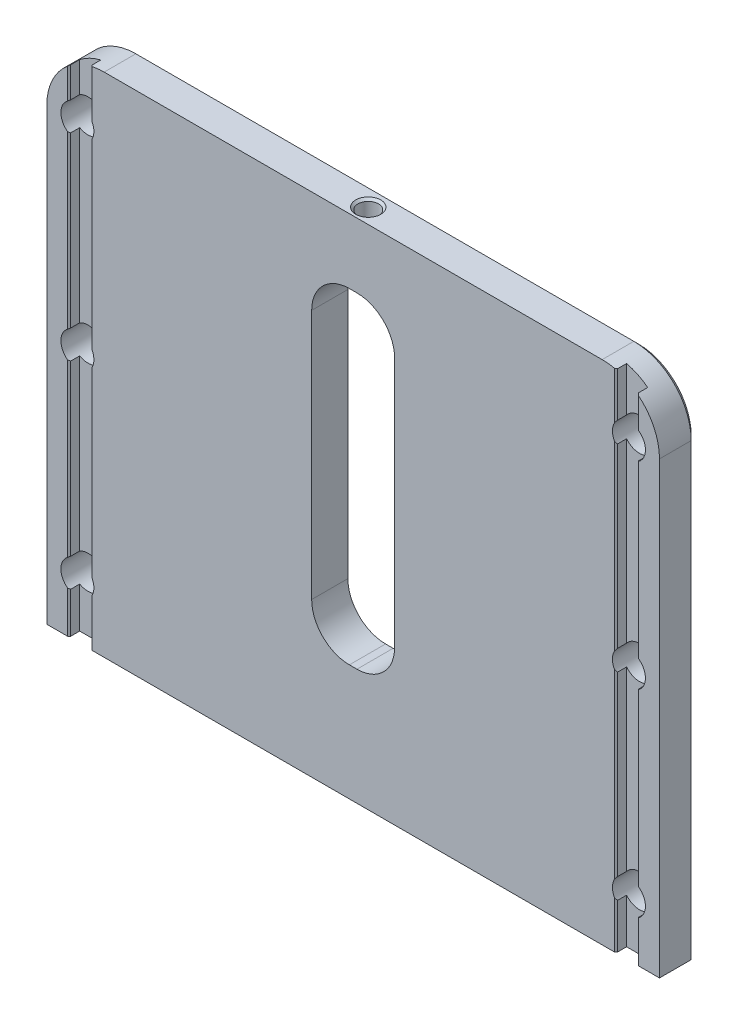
ISO-10303-21;
HEADER;
FILE_DESCRIPTION(('STEP AP214'),'2;1');
FILE_NAME('part.step','',(''),(''),'','','');
FILE_SCHEMA(('AUTOMOTIVE_DESIGN { 1 0 10303 214 1 1 1 1 }'));
ENDSEC;
DATA;
#1=APPLICATION_CONTEXT('core data for automotive mechanical design processes');
#2=APPLICATION_PROTOCOL_DEFINITION('international standard','automotive_design',2000,#1);
#3=PRODUCT_CONTEXT('',#1,'mechanical');
#4=PRODUCT('Part','Part','',(#3));
#5=PRODUCT_RELATED_PRODUCT_CATEGORY('part','',(#4));
#6=PRODUCT_DEFINITION_FORMATION('','',#4);
#7=PRODUCT_DEFINITION_CONTEXT('part definition',#1,'design');
#8=PRODUCT_DEFINITION('design','',#6,#7);
#9=PRODUCT_DEFINITION_SHAPE('','',#8);
#10=(LENGTH_UNIT() NAMED_UNIT(*) SI_UNIT(.MILLI.,.METRE.));
#11=(NAMED_UNIT(*) PLANE_ANGLE_UNIT() SI_UNIT($,.RADIAN.));
#12=(NAMED_UNIT(*) SI_UNIT($,.STERADIAN.) SOLID_ANGLE_UNIT());
#13=UNCERTAINTY_MEASURE_WITH_UNIT(LENGTH_MEASURE(1.E-05),#10,'distance_accuracy_value','');
#14=(GEOMETRIC_REPRESENTATION_CONTEXT(3) GLOBAL_UNCERTAINTY_ASSIGNED_CONTEXT((#13)) GLOBAL_UNIT_ASSIGNED_CONTEXT((#10,
#11,#12)) REPRESENTATION_CONTEXT('',''));
#15=CARTESIAN_POINT('',(0.,0.,0.));
#16=DIRECTION('',(0.,0.,1.));
#17=DIRECTION('',(1.,0.,0.));
#18=AXIS2_PLACEMENT_3D('',#15,#16,#17);
#19=CARTESIAN_POINT('',(-44.2595,85.598,-16.256));
#20=DIRECTION('',(-1.,0.,0.));
#21=DIRECTION('',(0.,0.,1.));
#22=AXIS2_PLACEMENT_3D('',#19,#20,#21);
#23=PLANE('',#22);
#24=DIRECTION('',(0.,0.,1.));
#25=VECTOR('',#24,1.);
#26=CARTESIAN_POINT('',(-44.2595,41.0664591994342,-22.352));
#27=LINE('',#26,#25);
#28=CARTESIAN_POINT('',(-44.2595,41.0664591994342,-18.034));
#29=VERTEX_POINT('',#28);
#30=CARTESIAN_POINT('',(-44.2595,41.0664591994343,-16.51));
#31=VERTEX_POINT('',#30);
#32=EDGE_CURVE('E63',#29,#31,#27,.T.);
#33=ORIENTED_EDGE('',*,*,#32,.F.);
#34=DIRECTION('',(0.,-1.,0.));
#35=VECTOR('',#34,1.);
#36=CARTESIAN_POINT('',(-44.2595,85.598,-18.034));
#37=LINE('',#36,#35);
#38=CARTESIAN_POINT('',(-44.2595,11.2575408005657,-18.034));
#39=VERTEX_POINT('',#38);
#40=EDGE_CURVE('E857',#29,#39,#37,.T.);
#41=ORIENTED_EDGE('',*,*,#40,.T.);
#42=DIRECTION('',(0.,0.,1.));
#43=VECTOR('',#42,1.);
#44=CARTESIAN_POINT('',(-44.2595,11.2575408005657,-17.145));
#45=LINE('',#44,#43);
#46=CARTESIAN_POINT('',(-44.2595,11.2575408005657,-16.51));
#47=VERTEX_POINT('',#46);
#48=EDGE_CURVE('E1090',#47,#39,#45,.F.);
#49=ORIENTED_EDGE('',*,*,#48,.F.);
#50=DIRECTION('',(0.,1.,0.));
#51=VECTOR('',#50,1.);
#52=CARTESIAN_POINT('',(-44.2595,85.598,-16.51));
#53=LINE('',#52,#51);
#54=EDGE_CURVE('E625',#47,#31,#53,.T.);
#55=ORIENTED_EDGE('',*,*,#54,.T.);
#56=EDGE_LOOP('',(#33,#41,#49,#55));
#57=FACE_BOUND('',#56,.T.);
#58=ADVANCED_FACE('F40',(#57),#23,.T.);
#59=CARTESIAN_POINT('',(44.2595,85.598,-16.256));
#60=DIRECTION('',(-1.,0.,0.));
#61=DIRECTION('',(0.,0.,1.));
#62=AXIS2_PLACEMENT_3D('',#59,#60,#61);
#63=PLANE('',#62);
#64=DIRECTION('',(0.,-1.,0.));
#65=VECTOR('',#64,1.);
#66=CARTESIAN_POINT('',(44.2595,85.598,-18.034));
#67=LINE('',#66,#65);
#68=CARTESIAN_POINT('',(44.2595,41.0664591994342,-18.034));
#69=VERTEX_POINT('',#68);
#70=CARTESIAN_POINT('',(44.2595,11.2575408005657,-18.034));
#71=VERTEX_POINT('',#70);
#72=EDGE_CURVE('E837',#69,#71,#67,.T.);
#73=ORIENTED_EDGE('',*,*,#72,.F.);
#74=DIRECTION('',(0.,0.,1.));
#75=VECTOR('',#74,1.);
#76=CARTESIAN_POINT('',(44.2595,41.0664591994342,-22.352));
#77=LINE('',#76,#75);
#78=CARTESIAN_POINT('',(44.2595,41.0664591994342,-16.51));
#79=VERTEX_POINT('',#78);
#80=EDGE_CURVE('E1233',#69,#79,#77,.T.);
#81=ORIENTED_EDGE('',*,*,#80,.T.);
#82=DIRECTION('',(0.,-1.,0.));
#83=VECTOR('',#82,1.);
#84=CARTESIAN_POINT('',(44.2595,11.2575408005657,-16.51));
#85=LINE('',#84,#83);
#86=CARTESIAN_POINT('',(44.2595,11.2575408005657,-16.51));
#87=VERTEX_POINT('',#86);
#88=EDGE_CURVE('E563',#79,#87,#85,.T.);
#89=ORIENTED_EDGE('',*,*,#88,.T.);
#90=DIRECTION('',(0.,0.,1.));
#91=VECTOR('',#90,1.);
#92=CARTESIAN_POINT('',(44.2595,11.2575408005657,-17.145));
#93=LINE('',#92,#91);
#94=EDGE_CURVE('E1374',#87,#71,#93,.F.);
#95=ORIENTED_EDGE('',*,*,#94,.T.);
#96=EDGE_LOOP('',(#73,#81,#89,#95));
#97=FACE_BOUND('',#96,.T.);
#98=ADVANCED_FACE('F1017',(#97),#63,.F.);
#99=CARTESIAN_POINT('',(44.2595,85.598,-18.034));
#100=DIRECTION('',(0.,0.,-1.));
#101=DIRECTION('',(-1.,0.,0.));
#102=AXIS2_PLACEMENT_3D('',#99,#100,#101);
#103=PLANE('',#102);
#104=CARTESIAN_POINT('',(44.2595,74.3404591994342,-18.034));
#105=VERTEX_POINT('',#104);
#106=CARTESIAN_POINT('',(44.2595,44.5315408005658,-18.034));
#107=VERTEX_POINT('',#106);
#108=EDGE_CURVE('E839',#105,#107,#67,.T.);
#109=ORIENTED_EDGE('',*,*,#108,.T.);
#110=CARTESIAN_POINT('',(46.4312,42.799,-18.034));
#111=DIRECTION('',(0.,0.,-1.));
#112=DIRECTION('',(-1.,0.,0.));
#113=AXIS2_PLACEMENT_3D('',#110,#111,#112);
#114=CIRCLE('',#113,2.778125);
#115=CARTESIAN_POINT('',(47.8155,45.2076701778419,-18.034));
#116=VERTEX_POINT('',#115);
#117=EDGE_CURVE('E1234',#107,#116,#114,.T.);
#118=ORIENTED_EDGE('',*,*,#117,.T.);
#119=DIRECTION('',(0.,-1.,0.));
#120=VECTOR('',#119,1.);
#121=CARTESIAN_POINT('',(47.8155,85.598,-18.034));
#122=LINE('',#121,#120);
#123=CARTESIAN_POINT('',(47.8155,73.6643298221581,-18.034));
#124=VERTEX_POINT('',#123);
#125=EDGE_CURVE('E844',#124,#116,#122,.T.);
#126=ORIENTED_EDGE('',*,*,#125,.F.);
#127=CARTESIAN_POINT('',(46.4312,76.073,-18.034));
#128=DIRECTION('',(0.,0.,-1.));
#129=DIRECTION('',(-1.,0.,0.));
#130=AXIS2_PLACEMENT_3D('',#127,#128,#129);
#131=CIRCLE('',#130,2.778125);
#132=EDGE_CURVE('E1359',#124,#105,#131,.T.);
#133=ORIENTED_EDGE('',*,*,#132,.T.);
#134=EDGE_LOOP('',(#109,#118,#126,#133));
#135=FACE_BOUND('',#134,.T.);
#136=ADVANCED_FACE('F1022',(#135),#103,.F.);
#137=CARTESIAN_POINT('',(47.8155,85.598,-17.78));
#138=DIRECTION('',(1.,0.,0.));
#139=DIRECTION('',(0.,0.,-1.));
#140=AXIS2_PLACEMENT_3D('',#137,#138,#139);
#141=PLANE('',#140);
#142=ORIENTED_EDGE('',*,*,#125,.T.);
#143=DIRECTION('',(0.,0.,1.));
#144=VECTOR('',#143,1.);
#145=CARTESIAN_POINT('',(47.8155,45.2076701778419,-22.352));
#146=LINE('',#145,#144);
#147=CARTESIAN_POINT('',(47.8155,45.2076701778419,-16.51));
#148=VERTEX_POINT('',#147);
#149=EDGE_CURVE('E1239',#116,#148,#146,.T.);
#150=ORIENTED_EDGE('',*,*,#149,.T.);
#151=DIRECTION('',(0.,1.,0.));
#152=VECTOR('',#151,1.);
#153=CARTESIAN_POINT('',(47.8155,85.598,-16.51));
#154=LINE('',#153,#152);
#155=CARTESIAN_POINT('',(47.8155,73.6643298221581,-16.51));
#156=VERTEX_POINT('',#155);
#157=EDGE_CURVE('E575',#148,#156,#154,.T.);
#158=ORIENTED_EDGE('',*,*,#157,.T.);
#159=DIRECTION('',(0.,0.,1.));
#160=VECTOR('',#159,1.);
#161=CARTESIAN_POINT('',(47.8155,73.6643298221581,-17.145));
#162=LINE('',#161,#160);
#163=EDGE_CURVE('E1370',#156,#124,#162,.F.);
#164=ORIENTED_EDGE('',*,*,#163,.T.);
#165=EDGE_LOOP('',(#142,#150,#158,#164));
#166=FACE_BOUND('',#165,.T.);
#167=ADVANCED_FACE('F1011',(#166),#141,.F.);
#168=CARTESIAN_POINT('',(-47.8155,85.598,-17.78));
#169=DIRECTION('',(1.,0.,0.));
#170=DIRECTION('',(0.,0.,-1.));
#171=AXIS2_PLACEMENT_3D('',#168,#169,#170);
#172=PLANE('',#171);
#173=DIRECTION('',(0.,0.,1.));
#174=VECTOR('',#173,1.);
#175=CARTESIAN_POINT('',(-47.8155,45.2076701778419,-22.352));
#176=LINE('',#175,#174);
#177=CARTESIAN_POINT('',(-47.8155,45.2076701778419,-18.034));
#178=VERTEX_POINT('',#177);
#179=CARTESIAN_POINT('',(-47.8155,45.2076701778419,-16.51));
#180=VERTEX_POINT('',#179);
#181=EDGE_CURVE('E1218',#178,#180,#176,.T.);
#182=ORIENTED_EDGE('',*,*,#181,.F.);
#183=DIRECTION('',(0.,-1.,0.));
#184=VECTOR('',#183,1.);
#185=CARTESIAN_POINT('',(-47.8155,85.598,-18.034));
#186=LINE('',#185,#184);
#187=CARTESIAN_POINT('',(-47.8155,73.6643298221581,-18.034));
#188=VERTEX_POINT('',#187);
#189=EDGE_CURVE('E850',#188,#178,#186,.T.);
#190=ORIENTED_EDGE('',*,*,#189,.F.);
#191=DIRECTION('',(0.,0.,1.));
#192=VECTOR('',#191,1.);
#193=CARTESIAN_POINT('',(-47.8155,73.6643298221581,-17.145));
#194=LINE('',#193,#192);
#195=CARTESIAN_POINT('',(-47.8155,73.6643298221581,-16.51));
#196=VERTEX_POINT('',#195);
#197=EDGE_CURVE('E1169',#196,#188,#194,.F.);
#198=ORIENTED_EDGE('',*,*,#197,.F.);
#199=DIRECTION('',(0.,-1.,0.));
#200=VECTOR('',#199,1.);
#201=CARTESIAN_POINT('',(-47.8155,85.598,-16.51));
#202=LINE('',#201,#200);
#203=EDGE_CURVE('E614',#196,#180,#202,.T.);
#204=ORIENTED_EDGE('',*,*,#203,.T.);
#205=EDGE_LOOP('',(#182,#190,#198,#204));
#206=FACE_BOUND('',#205,.T.);
#207=ADVANCED_FACE('F993',(#206),#172,.T.);
#208=CARTESIAN_POINT('',(-44.2595,85.598,-18.034));
#209=DIRECTION('',(0.,0.,1.));
#210=DIRECTION('',(1.,0.,0.));
#211=AXIS2_PLACEMENT_3D('',#208,#209,#210);
#212=PLANE('',#211);
#213=CARTESIAN_POINT('',(-46.4312,42.799,-18.034));
#214=DIRECTION('',(0.,0.,1.));
#215=DIRECTION('',(1.,0.,0.));
#216=AXIS2_PLACEMENT_3D('',#213,#214,#215);
#217=CIRCLE('',#216,2.778125);
#218=CARTESIAN_POINT('',(-44.2595,44.5315408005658,-18.034));
#219=VERTEX_POINT('',#218);
#220=EDGE_CURVE('E1212',#219,#178,#217,.T.);
#221=ORIENTED_EDGE('',*,*,#220,.F.);
#222=CARTESIAN_POINT('',(-44.2595,74.3404591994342,-18.034));
#223=VERTEX_POINT('',#222);
#224=EDGE_CURVE('E856',#223,#219,#37,.T.);
#225=ORIENTED_EDGE('',*,*,#224,.F.);
#226=CARTESIAN_POINT('',(-46.4312,76.073,-18.034));
#227=DIRECTION('',(0.,0.,1.));
#228=DIRECTION('',(1.,0.,0.));
#229=AXIS2_PLACEMENT_3D('',#226,#227,#228);
#230=CIRCLE('',#229,2.778125);
#231=EDGE_CURVE('E1166',#188,#223,#230,.T.);
#232=ORIENTED_EDGE('',*,*,#231,.F.);
#233=ORIENTED_EDGE('',*,*,#189,.T.);
#234=EDGE_LOOP('',(#221,#225,#232,#233));
#235=FACE_BOUND('',#234,.T.);
#236=ADVANCED_FACE('F1026',(#235),#212,.T.);
#237=CARTESIAN_POINT('',(44.2595,85.598,-16.51));
#238=DIRECTION('',(0.707106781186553,0.,0.707106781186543));
#239=DIRECTION('',(0.707106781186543,0.,-0.707106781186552));
#240=AXIS2_PLACEMENT_3D('',#237,#238,#239);
#241=PLANE('',#240);
#242=CARTESIAN_POINT('',(46.4312,42.799,-18.6817));
#243=DIRECTION('',(0.707106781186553,0.,0.707106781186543));
#244=DIRECTION('',(-0.707106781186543,0.,0.707106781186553));
#245=AXIS2_PLACEMENT_3D('',#242,#243,#244);
#246=ELLIPSE('',#245,3.92886205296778,2.778125);
#247=CARTESIAN_POINT('',(44.0055,41.444762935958,-16.256));
#248=VERTEX_POINT('',#247);
#249=EDGE_CURVE('E1237',#248,#79,#246,.T.);
#250=ORIENTED_EDGE('',*,*,#249,.F.);
#251=DIRECTION('',(0.,1.,0.));
#252=VECTOR('',#251,1.);
#253=CARTESIAN_POINT('',(44.0055,74.3404591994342,-16.256));
#254=LINE('',#253,#252);
#255=CARTESIAN_POINT('',(44.0055,10.879237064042,-16.256));
#256=VERTEX_POINT('',#255);
#257=EDGE_CURVE('E542',#256,#248,#254,.T.);
#258=ORIENTED_EDGE('',*,*,#257,.F.);
#259=CARTESIAN_POINT('',(46.4312,9.525,-18.6817));
#260=DIRECTION('',(0.707106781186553,0.,0.707106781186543));
#261=DIRECTION('',(-0.707106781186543,0.,0.707106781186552));
#262=AXIS2_PLACEMENT_3D('',#259,#260,#261);
#263=ELLIPSE('',#262,3.92886205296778,2.778125);
#264=EDGE_CURVE('E573',#87,#256,#263,.T.);
#265=ORIENTED_EDGE('',*,*,#264,.F.);
#266=ORIENTED_EDGE('',*,*,#88,.F.);
#267=EDGE_LOOP('',(#250,#258,#265,#266));
#268=FACE_BOUND('',#267,.T.);
#269=ADVANCED_FACE('F1591',(#268),#241,.T.);
#270=CARTESIAN_POINT('',(48.0695,85.598,-16.256));
#271=DIRECTION('',(0.707106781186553,0.,-0.707106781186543));
#272=DIRECTION('',(-0.707106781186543,0.,-0.707106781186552));
#273=AXIS2_PLACEMENT_3D('',#270,#271,#272);
#274=PLANE('',#273);
#275=CARTESIAN_POINT('',(46.4312,42.799,-17.8943));
#276=DIRECTION('',(0.707106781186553,0.,-0.707106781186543));
#277=DIRECTION('',(0.707106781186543,0.,0.707106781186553));
#278=AXIS2_PLACEMENT_3D('',#275,#276,#277);
#279=ELLIPSE('',#278,3.92886205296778,2.778125);
#280=CARTESIAN_POINT('',(48.0695,45.0426469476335,-16.256));
#281=VERTEX_POINT('',#280);
#282=EDGE_CURVE('E11',#281,#148,#279,.F.);
#283=ORIENTED_EDGE('',*,*,#282,.F.);
#284=DIRECTION('',(0.,-1.,0.));
#285=VECTOR('',#284,1.);
#286=CARTESIAN_POINT('',(48.0695,85.598,-16.256));
#287=LINE('',#286,#285);
#288=CARTESIAN_POINT('',(48.0695,73.8293530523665,-16.256));
#289=VERTEX_POINT('',#288);
#290=EDGE_CURVE('E555',#289,#281,#287,.T.);
#291=ORIENTED_EDGE('',*,*,#290,.F.);
#292=CARTESIAN_POINT('',(46.4312,76.073,-17.8943));
#293=DIRECTION('',(0.707106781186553,0.,-0.707106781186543));
#294=DIRECTION('',(0.707106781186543,0.,0.707106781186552));
#295=AXIS2_PLACEMENT_3D('',#292,#293,#294);
#296=ELLIPSE('',#295,3.92886205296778,2.778125);
#297=EDGE_CURVE('E1138',#156,#289,#296,.F.);
#298=ORIENTED_EDGE('',*,*,#297,.F.);
#299=ORIENTED_EDGE('',*,*,#157,.F.);
#300=EDGE_LOOP('',(#283,#291,#298,#299));
#301=FACE_BOUND('',#300,.T.);
#302=ADVANCED_FACE('F1301',(#301),#274,.F.);
#303=CARTESIAN_POINT('',(-47.8155,85.598,-16.51));
#304=DIRECTION('',(-0.707106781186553,0.,-0.707106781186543));
#305=DIRECTION('',(-0.707106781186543,0.,0.707106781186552));
#306=AXIS2_PLACEMENT_3D('',#303,#304,#305);
#307=PLANE('',#306);
#308=CARTESIAN_POINT('',(-46.4312,42.799,-17.8943));
#309=DIRECTION('',(-0.707106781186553,0.,-0.707106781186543));
#310=DIRECTION('',(-0.707106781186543,0.,0.707106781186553));
#311=AXIS2_PLACEMENT_3D('',#308,#309,#310);
#312=ELLIPSE('',#311,3.92886205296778,2.778125);
#313=CARTESIAN_POINT('',(-48.0695,40.5553530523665,-16.256));
#314=VERTEX_POINT('',#313);
#315=CARTESIAN_POINT('',(-47.8155,40.3903298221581,-16.51));
#316=VERTEX_POINT('',#315);
#317=EDGE_CURVE('E1223',#314,#316,#312,.F.);
#318=ORIENTED_EDGE('',*,*,#317,.F.);
#319=DIRECTION('',(0.,1.,0.));
#320=VECTOR('',#319,1.);
#321=CARTESIAN_POINT('',(-48.0695,85.598,-16.256));
#322=LINE('',#321,#320);
#323=CARTESIAN_POINT('',(-48.0695,11.7686469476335,-16.256));
#324=VERTEX_POINT('',#323);
#325=EDGE_CURVE('E608',#324,#314,#322,.T.);
#326=ORIENTED_EDGE('',*,*,#325,.F.);
#327=CARTESIAN_POINT('',(-46.4312,9.525,-17.8943));
#328=DIRECTION('',(-0.707106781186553,0.,-0.707106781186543));
#329=DIRECTION('',(-0.707106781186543,0.,0.707106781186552));
#330=AXIS2_PLACEMENT_3D('',#327,#328,#329);
#331=ELLIPSE('',#330,3.92886205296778,2.778125);
#332=CARTESIAN_POINT('',(-47.8155,11.9336701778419,-16.51));
#333=VERTEX_POINT('',#332);
#334=EDGE_CURVE('E596',#333,#324,#331,.F.);
#335=ORIENTED_EDGE('',*,*,#334,.F.);
#336=EDGE_CURVE('E613',#316,#333,#202,.T.);
#337=ORIENTED_EDGE('',*,*,#336,.F.);
#338=EDGE_LOOP('',(#318,#326,#335,#337));
#339=FACE_BOUND('',#338,.T.);
#340=ADVANCED_FACE('F1193',(#339),#307,.F.);
#341=CARTESIAN_POINT('',(-44.0055,85.598,-16.256));
#342=DIRECTION('',(0.707106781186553,0.,-0.707106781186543));
#343=DIRECTION('',(-0.707106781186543,0.,-0.707106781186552));
#344=AXIS2_PLACEMENT_3D('',#341,#342,#343);
#345=PLANE('',#344);
#346=CARTESIAN_POINT('',(-46.4312,42.799,-18.6817));
#347=DIRECTION('',(0.707106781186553,0.,-0.707106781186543));
#348=DIRECTION('',(0.707106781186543,0.,0.707106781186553));
#349=AXIS2_PLACEMENT_3D('',#346,#347,#348);
#350=ELLIPSE('',#349,3.92886205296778,2.778125);
#351=CARTESIAN_POINT('',(-44.0055,44.153237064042,-16.256));
#352=VERTEX_POINT('',#351);
#353=CARTESIAN_POINT('',(-44.2595,44.5315408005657,-16.51));
#354=VERTEX_POINT('',#353);
#355=EDGE_CURVE('E508',#352,#354,#350,.F.);
#356=ORIENTED_EDGE('',*,*,#355,.F.);
#357=DIRECTION('',(0.,-1.,0.));
#358=VECTOR('',#357,1.);
#359=CARTESIAN_POINT('',(-44.0055,85.598,-16.256));
#360=LINE('',#359,#358);
#361=CARTESIAN_POINT('',(-44.0055,74.718762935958,-16.256));
#362=VERTEX_POINT('',#361);
#363=EDGE_CURVE('E522',#362,#352,#360,.T.);
#364=ORIENTED_EDGE('',*,*,#363,.F.);
#365=CARTESIAN_POINT('',(-46.4312,76.073,-18.6817));
#366=DIRECTION('',(0.707106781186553,0.,-0.707106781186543));
#367=DIRECTION('',(0.707106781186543,0.,0.707106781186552));
#368=AXIS2_PLACEMENT_3D('',#365,#366,#367);
#369=ELLIPSE('',#368,3.92886205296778,2.778125);
#370=CARTESIAN_POINT('',(-44.2595,74.3404591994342,-16.51));
#371=VERTEX_POINT('',#370);
#372=EDGE_CURVE('E621',#371,#362,#369,.F.);
#373=ORIENTED_EDGE('',*,*,#372,.F.);
#374=EDGE_CURVE('E523',#354,#371,#53,.T.);
#375=ORIENTED_EDGE('',*,*,#374,.F.);
#376=EDGE_LOOP('',(#356,#364,#373,#375));
#377=FACE_BOUND('',#376,.T.);
#378=ADVANCED_FACE('F520',(#377),#345,.F.);
#379=CARTESIAN_POINT('',(-6.731,74.676,-215.23660628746));
#380=DIRECTION('',(0.,-1.,0.));
#381=DIRECTION('',(0.,0.,-1.));
#382=AXIS2_PLACEMENT_3D('',#379,#380,#381);
#383=PLANE('',#382);
#384=DIRECTION('',(0.,0.,1.));
#385=VECTOR('',#384,1.);
#386=CARTESIAN_POINT('',(0.635,74.676,-16.256));
#387=LINE('',#386,#385);
#388=CARTESIAN_POINT('',(0.635,74.676,-17.1897637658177));
#389=VERTEX_POINT('',#388);
#390=CARTESIAN_POINT('',(0.635,74.676,-16.812359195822));
#391=VERTEX_POINT('',#390);
#392=EDGE_CURVE('E893',#389,#391,#387,.T.);
#393=ORIENTED_EDGE('',*,*,#392,.T.);
#394=CARTESIAN_POINT('',(0.,74.676,-18.796));
#395=DIRECTION('',(0.,-1.,0.));
#396=DIRECTION('',(0.,0.,-1.));
#397=AXIS2_PLACEMENT_3D('',#394,#395,#396);
#398=CIRCLE('',#397,2.0828);
#399=CARTESIAN_POINT('',(-0.635,74.676,-16.812359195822));
#400=VERTEX_POINT('',#399);
#401=EDGE_CURVE('E778',#391,#400,#398,.T.);
#402=ORIENTED_EDGE('',*,*,#401,.T.);
#403=DIRECTION('',(0.,0.,1.));
#404=VECTOR('',#403,1.);
#405=CARTESIAN_POINT('',(-0.635,74.676,-22.352));
#406=LINE('',#405,#404);
#407=CARTESIAN_POINT('',(-0.635,74.676,-17.1897637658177));
#408=VERTEX_POINT('',#407);
#409=EDGE_CURVE('E939',#400,#408,#406,.F.);
#410=ORIENTED_EDGE('',*,*,#409,.T.);
#411=CARTESIAN_POINT('',(0.,74.676,-18.796));
#412=DIRECTION('',(0.,-1.,0.));
#413=DIRECTION('',(0.,0.,-1.));
#414=AXIS2_PLACEMENT_3D('',#411,#412,#413);
#415=CIRCLE('',#414,1.7272);
#416=EDGE_CURVE('E805',#408,#389,#415,.F.);
#417=ORIENTED_EDGE('',*,*,#416,.T.);
#418=EDGE_LOOP('',(#393,#402,#410,#417));
#419=FACE_BOUND('',#418,.T.);
#420=ADVANCED_FACE('F970',(#419),#383,.T.);
#421=DIRECTION('',(0.,0.,1.));
#422=VECTOR('',#421,1.);
#423=CARTESIAN_POINT('',(-0.635,74.676,-22.352));
#424=LINE('',#423,#422);
#425=CARTESIAN_POINT('',(-0.635,74.676,-20.4022362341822));
#426=VERTEX_POINT('',#425);
#427=CARTESIAN_POINT('',(-0.635,74.676,-20.779640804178));
#428=VERTEX_POINT('',#427);
#429=EDGE_CURVE('E947',#426,#428,#424,.F.);
#430=ORIENTED_EDGE('',*,*,#429,.T.);
#431=CARTESIAN_POINT('',(0.,74.676,-18.796));
#432=DIRECTION('',(0.,-1.,0.));
#433=DIRECTION('',(0.,0.,-1.));
#434=AXIS2_PLACEMENT_3D('',#431,#432,#433);
#435=CIRCLE('',#434,2.0828);
#436=CARTESIAN_POINT('',(0.635,74.676,-20.779640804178));
#437=VERTEX_POINT('',#436);
#438=EDGE_CURVE('E1250',#428,#437,#435,.T.);
#439=ORIENTED_EDGE('',*,*,#438,.T.);
#440=DIRECTION('',(0.,0.,1.));
#441=VECTOR('',#440,1.);
#442=CARTESIAN_POINT('',(0.635,74.676,-16.256));
#443=LINE('',#442,#441);
#444=CARTESIAN_POINT('',(0.635,74.676,-20.4022362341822));
#445=VERTEX_POINT('',#444);
#446=EDGE_CURVE('E886',#437,#445,#443,.T.);
#447=ORIENTED_EDGE('',*,*,#446,.T.);
#448=EDGE_CURVE('E804',#445,#426,#415,.F.);
#449=ORIENTED_EDGE('',*,*,#448,.T.);
#450=EDGE_LOOP('',(#430,#439,#447,#449));
#451=FACE_BOUND('',#450,.T.);
#452=ADVANCED_FACE('F751',(#451),#383,.T.);
#453=CARTESIAN_POINT('',(0.635,68.326,-215.23660628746));
#454=DIRECTION('',(0.,0.,-1.));
#455=DIRECTION('',(-1.,0.,0.));
#456=AXIS2_PLACEMENT_3D('',#453,#454,#455);
#457=CYLINDRICAL_SURFACE('',#456,6.35);
#458=CARTESIAN_POINT('',(0.635,74.676,-16.812359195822));
#459=CARTESIAN_POINT('',(0.69008338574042,74.6760034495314,-16.8299914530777));
#460=CARTESIAN_POINT('',(0.744401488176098,74.6752826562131,-16.849911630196));
#461=CARTESIAN_POINT('',(0.851154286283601,74.6725439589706,-16.8941765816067));
#462=CARTESIAN_POINT('',(0.903589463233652,74.670526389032,-16.9185202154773));
#463=CARTESIAN_POINT('',(1.05730986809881,74.6627686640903,-16.9978337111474));
#464=CARTESIAN_POINT('',(1.15530731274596,74.65532188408,-17.0591818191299));
#465=CARTESIAN_POINT('',(1.33955738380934,74.6374734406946,-17.1969714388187));
#466=CARTESIAN_POINT('',(1.42581564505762,74.627073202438,-17.2734056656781));
#467=CARTESIAN_POINT('',(1.58454600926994,74.6051152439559,-17.439367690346));
#468=CARTESIAN_POINT('',(1.65701363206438,74.5935571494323,-17.5288997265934));
#469=CARTESIAN_POINT('',(1.78764917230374,74.5708704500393,-17.7207664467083));
#470=CARTESIAN_POINT('',(1.8454766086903,74.5597563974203,-17.8233347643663));
#471=CARTESIAN_POINT('',(1.94309819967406,74.5400056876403,-18.0369249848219));
#472=CARTESIAN_POINT('',(1.9829015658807,74.5313677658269,-18.1479425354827));
#473=CARTESIAN_POINT('',(2.03609087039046,74.5195467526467,-18.3482937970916));
#474=CARTESIAN_POINT('',(2.05350162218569,74.515556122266,-18.4365324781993));
#475=CARTESIAN_POINT('',(2.07682999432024,74.5101459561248,-18.6145571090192));
#476=CARTESIAN_POINT('',(2.08275191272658,74.50872545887,-18.7043424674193));
#477=CARTESIAN_POINT('',(2.0827992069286,74.5087483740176,-18.7941824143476));
#478=B_SPLINE_CURVE_WITH_KNOTS('',3,(#458,#459,#460,#461,#462,#463,#464,#465,#466,#467,#468,
#469,#470,#471,#472,#473,#474,#475,#476,#477),.UNSPECIFIED.,.F.,.F.,(4,2,2,2,2,2,2,2,2,4),(0.,
0.173395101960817,0.346745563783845,0.692521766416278,1.03813140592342,1.38385313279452,
1.73699872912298,2.08996363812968,2.35929463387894,2.62852485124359),.UNSPECIFIED.);
#479=CARTESIAN_POINT('',(2.0827992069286,74.5087483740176,-18.7941824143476));
#480=VERTEX_POINT('',#479);
#481=EDGE_CURVE('E777',#391,#480,#478,.T.);
#482=ORIENTED_EDGE('',*,*,#481,.F.);
#483=ORIENTED_EDGE('',*,*,#392,.F.);
#484=CARTESIAN_POINT('',(0.635,74.676,-20.4022362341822));
#485=CARTESIAN_POINT('',(0.679871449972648,74.6760021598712,-20.3844973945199));
#486=CARTESIAN_POINT('',(0.723975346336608,74.6755240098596,-20.3648858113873));
#487=CARTESIAN_POINT('',(0.810368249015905,74.6737246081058,-20.3220566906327));
#488=CARTESIAN_POINT('',(0.852657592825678,74.6724035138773,-20.2988398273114));
#489=CARTESIAN_POINT('',(0.976224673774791,74.667359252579,-20.2240910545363));
#490=CARTESIAN_POINT('',(1.05440440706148,74.6625540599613,-20.1673804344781));
#491=CARTESIAN_POINT('',(1.20012297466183,74.6512272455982,-20.0418672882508));
#492=CARTESIAN_POINT('',(1.26766290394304,74.6447058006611,-19.9730660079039));
#493=CARTESIAN_POINT('',(1.39037849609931,74.6312136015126,-19.8252193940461));
#494=CARTESIAN_POINT('',(1.44555311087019,74.6242428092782,-19.7461731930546));
#495=CARTESIAN_POINT('',(1.54261923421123,74.6109954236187,-19.5789473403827));
#496=CARTESIAN_POINT('',(1.58434050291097,74.604728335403,-19.4906680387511));
#497=CARTESIAN_POINT('',(1.65236334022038,74.5940671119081,-19.3082402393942));
#498=CARTESIAN_POINT('',(1.67866475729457,74.5896729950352,-19.2140916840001));
#499=CARTESIAN_POINT('',(1.71491969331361,74.5835245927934,-19.0232488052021));
#500=CARTESIAN_POINT('',(1.7249789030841,74.5817532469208,-18.9265751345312));
#501=CARTESIAN_POINT('',(1.72876192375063,74.5810930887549,-18.7329056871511));
#502=CARTESIAN_POINT('',(1.72248730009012,74.5822040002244,-18.6359099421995));
#503=CARTESIAN_POINT('',(1.69396871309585,74.5870931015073,-18.4454935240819));
#504=CARTESIAN_POINT('',(1.67190566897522,74.5908410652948,-18.3520448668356));
#505=CARTESIAN_POINT('',(1.61267400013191,74.6003562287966,-18.1701814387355));
#506=CARTESIAN_POINT('',(1.57550551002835,74.6061234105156,-18.0817666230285));
#507=CARTESIAN_POINT('',(1.48674868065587,74.6187770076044,-17.9116467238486));
#508=CARTESIAN_POINT('',(1.43504291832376,74.6256723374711,-17.830003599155));
#509=CARTESIAN_POINT('',(1.3187184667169,74.6393547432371,-17.6764083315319));
#510=CARTESIAN_POINT('',(1.25409184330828,74.646141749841,-17.6044621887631));
#511=CARTESIAN_POINT('',(1.11290571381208,74.6583914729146,-17.4715482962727));
#512=CARTESIAN_POINT('',(1.03622058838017,74.6638384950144,-17.4107126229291));
#513=CARTESIAN_POINT('',(0.873708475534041,74.6720288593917,-17.3029110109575));
#514=CARTESIAN_POINT('',(0.787905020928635,74.6747789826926,-17.255910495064));
#515=CARTESIAN_POINT('',(0.677753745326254,74.6758921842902,-17.2071608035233));
#516=CARTESIAN_POINT('',(0.656458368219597,74.6760015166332,-17.1982436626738));
#517=CARTESIAN_POINT('',(0.635,74.676,-17.1897637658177));
#518=B_SPLINE_CURVE_WITH_KNOTS('',3,(#484,#485,#486,#487,#488,#489,#490,#491,#492,#493,#494,
#495,#496,#497,#498,#499,#500,#501,#502,#503,#504,#505,#506,#507,#508,#509,#510,#511,#512,#513,
#514,#515,#516,#517),.UNSPECIFIED.,.F.,.F.,(4,2,2,2,2,2,2,2,2,2,2,2,2,2,2,2,4),(0.,
0.144657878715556,0.289288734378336,0.577903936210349,0.866489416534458,1.1550993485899,
1.44722980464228,1.7393631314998,2.02958772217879,2.31978449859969,2.60670809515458,
2.89362913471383,3.18293783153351,3.47242472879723,3.76515602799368,4.05714938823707,
4.12638972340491),.UNSPECIFIED.);
#519=EDGE_CURVE('E759',#445,#389,#518,.T.);
#520=ORIENTED_EDGE('',*,*,#519,.F.);
#521=ORIENTED_EDGE('',*,*,#446,.F.);
#522=CARTESIAN_POINT('',(2.0828,74.5087481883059,-18.796));
#523=CARTESIAN_POINT('',(2.08280054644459,74.5087432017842,-18.8538939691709));
#524=CARTESIAN_POINT('',(2.08038462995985,74.5093143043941,-18.9117592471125));
#525=CARTESIAN_POINT('',(2.07075271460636,74.5115598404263,-19.0270578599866));
#526=CARTESIAN_POINT('',(2.06353751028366,74.5132340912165,-19.0844912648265));
#527=CARTESIAN_POINT('',(2.03479195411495,74.5198269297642,-19.2553080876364));
#528=CARTESIAN_POINT('',(2.00616125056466,74.5263161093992,-19.3675192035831));
#529=CARTESIAN_POINT('',(1.93086713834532,74.5424853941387,-19.5853741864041));
#530=CARTESIAN_POINT('',(1.88420618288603,74.552165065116,-19.6910189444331));
#531=CARTESIAN_POINT('',(1.7741766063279,74.5732317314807,-19.8930801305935));
#532=CARTESIAN_POINT('',(1.71080251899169,74.5846192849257,-19.9894935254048));
#533=CARTESIAN_POINT('',(1.56780007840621,74.6075368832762,-20.1721353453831));
#534=CARTESIAN_POINT('',(1.4879083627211,74.6190659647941,-20.2581576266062));
#535=CARTESIAN_POINT('',(1.31469470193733,74.6401196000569,-20.415666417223));
#536=CARTESIAN_POINT('',(1.22138029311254,74.6496452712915,-20.487161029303));
#537=CARTESIAN_POINT('',(1.04686523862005,74.663083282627,-20.5988377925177));
#538=CARTESIAN_POINT('',(0.967890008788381,74.6677857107,-20.6424355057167));
#539=CARTESIAN_POINT('',(0.804897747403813,74.6742578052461,-20.7191064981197));
#540=CARTESIAN_POINT('',(0.720881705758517,74.6760280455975,-20.7521818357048));
#541=CARTESIAN_POINT('',(0.634999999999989,74.676,-20.779640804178));
#542=B_SPLINE_CURVE_WITH_KNOTS('',3,(#522,#523,#524,#525,#526,#527,#528,#529,#530,#531,#532,
#533,#534,#535,#536,#537,#538,#539,#540,#541),.UNSPECIFIED.,.F.,.F.,(4,2,2,2,2,2,2,2,2,4),(0.,
0.173572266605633,0.347115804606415,0.69328177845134,1.0394006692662,1.38563290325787,
1.73788280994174,2.08993570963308,2.36016289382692,2.63033718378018),.UNSPECIFIED.);
#543=CARTESIAN_POINT('',(2.0828,74.5087481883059,-18.796));
#544=VERTEX_POINT('',#543);
#545=EDGE_CURVE('E771',#544,#437,#542,.T.);
#546=ORIENTED_EDGE('',*,*,#545,.F.);
#547=CARTESIAN_POINT('',(0.635,68.326,-18.796));
#548=DIRECTION('',(0.,0.,1.));
#549=DIRECTION('',(1.,0.,0.));
#550=AXIS2_PLACEMENT_3D('',#547,#548,#549);
#551=CIRCLE('',#550,6.35);
#552=CARTESIAN_POINT('',(2.083054,74.5086887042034,-18.796));
#553=VERTEX_POINT('',#552);
#554=EDGE_CURVE('E696',#553,#544,#551,.T.);
#555=ORIENTED_EDGE('',*,*,#554,.F.);
#556=CARTESIAN_POINT('',(2.083054,74.5086887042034,-18.796));
#557=CARTESIAN_POINT('',(2.08305454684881,74.5086837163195,-18.853900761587));
#558=CARTESIAN_POINT('',(2.08063835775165,74.50925498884,-18.9117728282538));
#559=CARTESIAN_POINT('',(2.07100535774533,74.5115011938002,-19.0270849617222));
#560=CARTESIAN_POINT('',(2.06378934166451,74.5131759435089,-19.0845250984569));
#561=CARTESIAN_POINT('',(2.03504056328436,74.5197707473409,-19.2553618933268));
#562=CARTESIAN_POINT('',(2.00640666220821,74.5262618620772,-19.3675861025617));
#563=CARTESIAN_POINT('',(1.93110419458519,74.5424360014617,-19.5854664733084));
#564=CARTESIAN_POINT('',(1.88443808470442,74.5521185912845,-19.691123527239));
#565=CARTESIAN_POINT('',(1.77439639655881,74.5731917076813,-19.893208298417));
#566=CARTESIAN_POINT('',(1.71101534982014,74.5845827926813,-19.9896329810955));
#567=CARTESIAN_POINT('',(1.5679967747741,74.6075077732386,-20.1722968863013));
#568=CARTESIAN_POINT('',(1.48809576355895,74.6190407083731,-20.2583298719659));
#569=CARTESIAN_POINT('',(1.31486181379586,74.6401017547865,-20.4158584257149));
#570=CARTESIAN_POINT('',(1.22153641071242,74.64963098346,-20.4873620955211));
#571=CARTESIAN_POINT('',(1.04698802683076,74.663075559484,-20.5990612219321));
#572=CARTESIAN_POINT('',(0.96798971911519,74.6677807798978,-20.6426710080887));
#573=CARTESIAN_POINT('',(0.804949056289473,74.674256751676,-20.7193613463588));
#574=CARTESIAN_POINT('',(0.720907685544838,74.6760280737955,-20.7524439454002));
#575=CARTESIAN_POINT('',(0.634999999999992,74.676,-20.7799074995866));
#576=B_SPLINE_CURVE_WITH_KNOTS('',3,(#556,#557,#558,#559,#560,#561,#562,#563,#564,#565,#566,
#567,#568,#569,#570,#571,#572,#573,#574,#575),.UNSPECIFIED.,.F.,.F.,(4,2,2,2,2,2,2,2,2,4),(0.,
0.17359262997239,0.347156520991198,0.693362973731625,1.03952227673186,1.38579497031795,
1.73808811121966,2.09018426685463,2.36048938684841,2.63074191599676),.UNSPECIFIED.);
#577=CARTESIAN_POINT('',(0.635,74.676,-20.7799074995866));
#578=VERTEX_POINT('',#577);
#579=EDGE_CURVE('E731',#553,#578,#576,.T.);
#580=ORIENTED_EDGE('',*,*,#579,.T.);
#581=CARTESIAN_POINT('',(0.635,74.676,-22.352));
#582=VERTEX_POINT('',#581);
#583=EDGE_CURVE('E883',#582,#578,#443,.T.);
#584=ORIENTED_EDGE('',*,*,#583,.F.);
#585=CARTESIAN_POINT('',(0.635,68.326,-22.352));
#586=DIRECTION('',(0.,0.,-1.));
#587=DIRECTION('',(-1.,0.,0.));
#588=AXIS2_PLACEMENT_3D('',#585,#586,#587);
#589=CIRCLE('',#588,6.35);
#590=CARTESIAN_POINT('',(6.985,68.326,-22.352));
#591=VERTEX_POINT('',#590);
#592=EDGE_CURVE('E880',#591,#582,#589,.F.);
#593=ORIENTED_EDGE('',*,*,#592,.F.);
#594=DIRECTION('',(0.,0.,1.));
#595=VECTOR('',#594,1.);
#596=CARTESIAN_POINT('',(6.985,68.326,-22.352));
#597=LINE('',#596,#595);
#598=CARTESIAN_POINT('',(6.985,68.326,-16.256));
#599=VERTEX_POINT('',#598);
#600=EDGE_CURVE('E872',#599,#591,#597,.F.);
#601=ORIENTED_EDGE('',*,*,#600,.F.);
#602=CARTESIAN_POINT('',(0.635,68.326,-16.256));
#603=DIRECTION('',(0.,0.,1.));
#604=DIRECTION('',(1.,0.,0.));
#605=AXIS2_PLACEMENT_3D('',#602,#603,#604);
#606=CIRCLE('',#605,6.35);
#607=CARTESIAN_POINT('',(0.635,74.676,-16.256));
#608=VERTEX_POINT('',#607);
#609=EDGE_CURVE('E882',#608,#599,#606,.F.);
#610=ORIENTED_EDGE('',*,*,#609,.F.);
#611=CARTESIAN_POINT('',(0.635,74.676,-16.8120925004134));
#612=VERTEX_POINT('',#611);
#613=EDGE_CURVE('E900',#612,#608,#387,.T.);
#614=ORIENTED_EDGE('',*,*,#613,.F.);
#615=CARTESIAN_POINT('',(0.635,74.676,-16.8120925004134));
#616=CARTESIAN_POINT('',(0.690090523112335,74.6760034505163,-16.8297246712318));
#617=CARTESIAN_POINT('',(0.744415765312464,74.6752824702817,-16.8496450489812));
#618=CARTESIAN_POINT('',(0.851182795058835,74.6725430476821,-16.8939109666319));
#619=CARTESIAN_POINT('',(0.903625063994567,74.6705249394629,-16.9182553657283));
#620=CARTESIAN_POINT('',(1.05736653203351,74.6627651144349,-16.9975719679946));
#621=CARTESIAN_POINT('',(1.15537781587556,74.6553162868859,-17.0589232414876));
#622=CARTESIAN_POINT('',(1.33965479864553,74.6374627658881,-17.1967212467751));
#623=CARTESIAN_POINT('',(1.42592613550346,74.6270594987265,-17.2731606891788));
#624=CARTESIAN_POINT('',(1.58468168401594,74.6050948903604,-17.4391350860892));
#625=CARTESIAN_POINT('',(1.65716141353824,74.5935331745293,-17.5286742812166));
#626=CARTESIAN_POINT('',(1.78782065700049,74.570838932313,-17.7205579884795));
#627=CARTESIAN_POINT('',(1.8456595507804,74.5597209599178,-17.823136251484));
#628=CARTESIAN_POINT('',(1.9433022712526,74.5399628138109,-18.0367482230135));
#629=CARTESIAN_POINT('',(1.98311530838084,74.5313213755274,-18.1477775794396));
#630=CARTESIAN_POINT('',(2.03632360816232,74.5194941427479,-18.3481654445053));
#631=CARTESIAN_POINT('',(2.0537422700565,74.5155009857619,-18.4364290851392));
#632=CARTESIAN_POINT('',(2.0770812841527,74.5100873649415,-18.6145047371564));
#633=CARTESIAN_POINT('',(2.0830059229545,74.5086659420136,-18.7043161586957));
#634=CARTESIAN_POINT('',(2.08305320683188,74.5086888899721,-18.7941821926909));
#635=B_SPLINE_CURVE_WITH_KNOTS('',3,(#615,#616,#617,#618,#619,#620,#621,#622,#623,#624,#625,
#626,#627,#628,#629,#630,#631,#632,#633,#634),.UNSPECIFIED.,.F.,.F.,(4,2,2,2,2,2,2,2,2,4),(0.,
0.173415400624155,0.346786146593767,0.692602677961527,1.03825254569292,1.38401455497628,
1.73720373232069,2.09021224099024,2.35962104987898,2.62892936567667),.UNSPECIFIED.);
#636=CARTESIAN_POINT('',(2.08305320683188,74.5086888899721,-18.7941821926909));
#637=VERTEX_POINT('',#636);
#638=EDGE_CURVE('E738',#612,#637,#635,.T.);
#639=ORIENTED_EDGE('',*,*,#638,.T.);
#640=CARTESIAN_POINT('',(0.635,68.326,-18.7954458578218));
#641=DIRECTION('',(-0.000872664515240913,0.,0.99999961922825));
#642=DIRECTION('',(-0.99999961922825,0.,-0.000872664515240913));
#643=AXIS2_PLACEMENT_3D('',#640,#641,#642);
#644=ELLIPSE('',#643,6.35000241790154,6.35);
#645=EDGE_CURVE('E785',#480,#637,#644,.F.);
#646=ORIENTED_EDGE('',*,*,#645,.F.);
#647=EDGE_LOOP('',(#482,#483,#520,#521,#546,#555,#580,#584,#593,#601,#610,#614,#639,#646));
#648=FACE_BOUND('',#647,.T.);
#649=ADVANCED_FACE('F745',(#648),#457,.F.);
#650=CARTESIAN_POINT('',(-0.635,68.326,-215.23660628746));
#651=DIRECTION('',(0.,0.,-1.));
#652=DIRECTION('',(-1.,0.,0.));
#653=AXIS2_PLACEMENT_3D('',#650,#651,#652);
#654=CYLINDRICAL_SURFACE('',#653,6.35);
#655=CARTESIAN_POINT('',(-0.635,74.676,-20.779640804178));
#656=CARTESIAN_POINT('',(-0.690086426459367,74.6760034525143,-20.7620075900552));
#657=CARTESIAN_POINT('',(-0.744407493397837,74.6752825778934,-20.7420861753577));
#658=CARTESIAN_POINT('',(-0.851165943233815,74.6725435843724,-20.6978182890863));
#659=CARTESIAN_POINT('',(-0.903603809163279,74.6705258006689,-20.6734729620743));
#660=CARTESIAN_POINT('',(-1.05732064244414,74.6627678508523,-20.5941595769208));
#661=CARTESIAN_POINT('',(-1.15531233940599,74.6553214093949,-20.5328145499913));
#662=CARTESIAN_POINT('',(-1.33955807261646,74.6374733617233,-20.3950279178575));
#663=CARTESIAN_POINT('',(-1.42581701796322,74.6270729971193,-20.3185926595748));
#664=CARTESIAN_POINT('',(-1.58454693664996,74.6051151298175,-20.1526315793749));
#665=CARTESIAN_POINT('',(-1.65701362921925,74.5935572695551,-20.0631017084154));
#666=CARTESIAN_POINT('',(-1.78763423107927,74.5708729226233,-19.8712540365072));
#667=CARTESIAN_POINT('',(-1.84545140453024,74.5597608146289,-19.7687049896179));
#668=CARTESIAN_POINT('',(-1.94307761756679,74.5400105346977,-19.5551354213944));
#669=CARTESIAN_POINT('',(-1.98288745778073,74.5313722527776,-19.4441152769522));
#670=CARTESIAN_POINT('',(-2.04307590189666,74.5179930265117,-19.2173906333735));
#671=CARTESIAN_POINT('',(-2.06356739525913,74.5132294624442,-19.101717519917));
#672=CARTESIAN_POINT('',(-2.08482790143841,74.5082830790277,-18.8684885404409));
#673=CARTESIAN_POINT('',(-2.08560078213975,74.5080993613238,-18.7509330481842));
#674=CARTESIAN_POINT('',(-2.06762142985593,74.5122889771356,-18.5201685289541));
#675=CARTESIAN_POINT('',(-2.04932160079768,74.5165567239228,-18.4069219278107));
#676=CARTESIAN_POINT('',(-1.99448396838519,74.5288287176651,-18.185148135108));
#677=CARTESIAN_POINT('',(-1.95794466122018,74.5368332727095,-18.0766213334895));
#678=CARTESIAN_POINT('',(-1.86739334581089,74.5554339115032,-17.8664356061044));
#679=CARTESIAN_POINT('',(-1.813257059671,74.566048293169,-17.7648319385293));
#680=CARTESIAN_POINT('',(-1.68905873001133,74.5882221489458,-17.5719502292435));
#681=CARTESIAN_POINT('',(-1.61899141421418,74.59978193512,-17.4806756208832));
#682=CARTESIAN_POINT('',(-1.46289672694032,74.6223041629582,-17.3087904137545));
#683=CARTESIAN_POINT('',(-1.37652722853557,74.6332456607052,-17.2284876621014));
#684=CARTESIAN_POINT('',(-1.19132791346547,74.6522642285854,-17.0835209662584));
#685=CARTESIAN_POINT('',(-1.09251247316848,74.6603445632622,-17.0188392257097));
#686=CARTESIAN_POINT('',(-0.932429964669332,74.6692839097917,-16.9324642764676));
#687=CARTESIAN_POINT('',(-0.874506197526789,74.6717558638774,-16.9045931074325));
#688=CARTESIAN_POINT('',(-0.756367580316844,74.6751159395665,-16.8543305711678));
#689=CARTESIAN_POINT('',(-0.696155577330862,74.6760059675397,-16.8319326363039));
#690=CARTESIAN_POINT('',(-0.635,74.676,-16.812359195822));
#691=B_SPLINE_CURVE_WITH_KNOTS('',3,(#655,#656,#657,#658,#659,#660,#661,#662,#663,#664,#665,
#666,#667,#668,#669,#670,#671,#672,#673,#674,#675,#676,#677,#678,#679,#680,#681,#682,#683,#684,
#685,#686,#687,#688,#689,#690),.UNSPECIFIED.,.F.,.F.,(4,2,2,2,2,2,2,2,2,2,2,2,2,2,2,2,2,4),(0.,
0.173404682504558,0.346764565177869,0.692521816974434,1.03813395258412,1.38385318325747,
1.73691628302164,2.08996368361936,2.440934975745,2.79183742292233,3.13460186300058,
3.47739456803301,3.82266283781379,4.16804553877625,4.52170219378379,4.87495402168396,
5.06767515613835,5.2601638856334),.UNSPECIFIED.);
#692=EDGE_CURVE('E1254',#428,#400,#691,.T.);
#693=ORIENTED_EDGE('',*,*,#692,.F.);
#694=ORIENTED_EDGE('',*,*,#429,.F.);
#695=CARTESIAN_POINT('',(-0.635,74.676,-17.1897637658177));
#696=CARTESIAN_POINT('',(-0.679871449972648,74.6760021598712,-17.2075026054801));
#697=CARTESIAN_POINT('',(-0.723975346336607,74.6755240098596,-17.2271141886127));
#698=CARTESIAN_POINT('',(-0.810368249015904,74.6737246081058,-17.2699433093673));
#699=CARTESIAN_POINT('',(-0.852657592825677,74.6724035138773,-17.2931601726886));
#700=CARTESIAN_POINT('',(-0.976224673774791,74.667359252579,-17.3679089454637));
#701=CARTESIAN_POINT('',(-1.05440440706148,74.6625540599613,-17.4246195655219));
#702=CARTESIAN_POINT('',(-1.20012297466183,74.6512272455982,-17.5501327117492));
#703=CARTESIAN_POINT('',(-1.26766290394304,74.6447058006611,-17.6189339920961));
#704=CARTESIAN_POINT('',(-1.39037849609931,74.6312136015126,-17.7667806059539));
#705=CARTESIAN_POINT('',(-1.44555311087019,74.6242428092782,-17.8458268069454));
#706=CARTESIAN_POINT('',(-1.54261923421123,74.6109954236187,-18.0130526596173));
#707=CARTESIAN_POINT('',(-1.58434050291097,74.604728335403,-18.1013319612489));
#708=CARTESIAN_POINT('',(-1.65236334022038,74.5940671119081,-18.2837597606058));
#709=CARTESIAN_POINT('',(-1.67866475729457,74.5896729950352,-18.3779083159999));
#710=CARTESIAN_POINT('',(-1.71491969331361,74.5835245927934,-18.5687511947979));
#711=CARTESIAN_POINT('',(-1.7249789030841,74.5817532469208,-18.6654248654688));
#712=CARTESIAN_POINT('',(-1.72876192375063,74.5810930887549,-18.8590943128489));
#713=CARTESIAN_POINT('',(-1.72248730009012,74.5822040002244,-18.9560900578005));
#714=CARTESIAN_POINT('',(-1.69396871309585,74.5870931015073,-19.1465064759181));
#715=CARTESIAN_POINT('',(-1.67190566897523,74.5908410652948,-19.2399551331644));
#716=CARTESIAN_POINT('',(-1.61267400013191,74.6003562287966,-19.4218185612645));
#717=CARTESIAN_POINT('',(-1.57550551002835,74.6061234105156,-19.5102333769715));
#718=CARTESIAN_POINT('',(-1.48674868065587,74.6187770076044,-19.6803532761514));
#719=CARTESIAN_POINT('',(-1.43504291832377,74.6256723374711,-19.761996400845));
#720=CARTESIAN_POINT('',(-1.31871846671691,74.6393547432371,-19.9155916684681));
#721=CARTESIAN_POINT('',(-1.25409184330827,74.646141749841,-19.9875378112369));
#722=CARTESIAN_POINT('',(-1.11290571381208,74.6583914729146,-20.1204517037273));
#723=CARTESIAN_POINT('',(-1.03622058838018,74.6638384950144,-20.1812873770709));
#724=CARTESIAN_POINT('',(-0.873708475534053,74.6720288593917,-20.2890889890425));
#725=CARTESIAN_POINT('',(-0.787905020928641,74.6747789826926,-20.336089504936));
#726=CARTESIAN_POINT('',(-0.677753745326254,74.6758921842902,-20.3848391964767));
#727=CARTESIAN_POINT('',(-0.656458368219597,74.6760015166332,-20.3937563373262));
#728=CARTESIAN_POINT('',(-0.635,74.676,-20.4022362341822));
#729=B_SPLINE_CURVE_WITH_KNOTS('',3,(#695,#696,#697,#698,#699,#700,#701,#702,#703,#704,#705,
#706,#707,#708,#709,#710,#711,#712,#713,#714,#715,#716,#717,#718,#719,#720,#721,#722,#723,#724,
#725,#726,#727,#728),.UNSPECIFIED.,.F.,.F.,(4,2,2,2,2,2,2,2,2,2,2,2,2,2,2,2,4),(0.,
0.144657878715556,0.289288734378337,0.57790393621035,0.86648941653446,1.1550993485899,
1.44722980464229,1.73936313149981,2.02958772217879,2.31978449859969,2.60670809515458,
2.89362913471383,3.18293783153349,3.4724247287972,3.76515602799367,4.05714938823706,
4.1263897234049),.UNSPECIFIED.);
#730=EDGE_CURVE('E940',#408,#426,#729,.T.);
#731=ORIENTED_EDGE('',*,*,#730,.F.);
#732=ORIENTED_EDGE('',*,*,#409,.F.);
#733=EDGE_LOOP('',(#693,#694,#731,#732));
#734=FACE_BOUND('',#733,.T.);
#735=ADVANCED_FACE('F750',(#734),#654,.F.);
#736=CARTESIAN_POINT('',(0.,85.598,-18.796));
#737=DIRECTION('',(0.,1.,0.));
#738=DIRECTION('',(0.,0.,1.));
#739=AXIS2_PLACEMENT_3D('',#736,#737,#738);
#740=CONICAL_SURFACE('',#739,2.1082,0.785398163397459);
#741=CARTESIAN_POINT('',(0.,85.598,-18.796));
#742=DIRECTION('',(0.,1.,0.));
#743=DIRECTION('',(-1.,0.,0.));
#744=AXIS2_PLACEMENT_3D('',#741,#742,#743);
#745=CIRCLE('',#744,2.1082);
#746=CARTESIAN_POINT('',(-2.1082,85.598,-18.796));
#747=VERTEX_POINT('',#746);
#748=EDGE_CURVE('E663',#747,#747,#745,.F.);
#749=ORIENTED_EDGE('',*,*,#748,.F.);
#750=EDGE_LOOP('',(#749));
#751=FACE_BOUND('',#750,.T.);
#752=CARTESIAN_POINT('',(0.,85.217,-18.796));
#753=DIRECTION('',(0.,1.,0.));
#754=DIRECTION('',(0.,0.,1.));
#755=AXIS2_PLACEMENT_3D('',#752,#753,#754);
#756=CIRCLE('',#755,1.7272);
#757=CARTESIAN_POINT('',(0.,85.217,-17.0688));
#758=VERTEX_POINT('',#757);
#759=EDGE_CURVE('E666',#758,#758,#756,.T.);
#760=ORIENTED_EDGE('',*,*,#759,.F.);
#761=EDGE_LOOP('',(#760));
#762=FACE_BOUND('',#761,.T.);
#763=DIRECTION('',(0.707106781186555,0.70710678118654,0.));
#764=VECTOR('',#763,1.);
#765=CARTESIAN_POINT('',(0.,83.4898,-18.796));
#766=LINE('',#765,#764);
#767=CARTESIAN_POINT('',(2.083054,85.572854,-18.796));
#768=VERTEX_POINT('',#767);
#769=CARTESIAN_POINT('',(2.0828,85.5726,-18.796));
#770=VERTEX_POINT('',#769);
#771=EDGE_CURVE('E674',#768,#770,#766,.F.);
#772=ORIENTED_EDGE('',*,*,#771,.T.);
#773=CARTESIAN_POINT('',(0.,85.5726,-18.796));
#774=DIRECTION('',(0.,1.,0.));
#775=DIRECTION('',(0.,0.,1.));
#776=AXIS2_PLACEMENT_3D('',#773,#774,#775);
#777=CIRCLE('',#776,2.0828);
#778=CARTESIAN_POINT('',(2.0827992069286,85.5726,-18.7941824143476));
#779=VERTEX_POINT('',#778);
#780=EDGE_CURVE('E677',#770,#779,#777,.T.);
#781=ORIENTED_EDGE('',*,*,#780,.T.);
#782=DIRECTION('',(0.707106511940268,0.70710678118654,0.000617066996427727));
#783=VECTOR('',#782,1.);
#784=CARTESIAN_POINT('',(0.,83.4898,-18.796));
#785=LINE('',#784,#783);
#786=CARTESIAN_POINT('',(2.08305320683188,85.572854,-18.7941821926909));
#787=VERTEX_POINT('',#786);
#788=EDGE_CURVE('E671',#779,#787,#785,.T.);
#789=ORIENTED_EDGE('',*,*,#788,.T.);
#790=CARTESIAN_POINT('',(0.,85.572854,-18.796));
#791=DIRECTION('',(0.,1.,0.));
#792=DIRECTION('',(0.,0.,1.));
#793=AXIS2_PLACEMENT_3D('',#790,#791,#792);
#794=CIRCLE('',#793,2.083054);
#795=EDGE_CURVE('E669',#768,#787,#794,.T.);
#796=ORIENTED_EDGE('',*,*,#795,.F.);
#797=EDGE_LOOP('',(#772,#781,#789,#796));
#798=FACE_BOUND('',#797,.T.);
#799=ADVANCED_FACE('F680',(#751,#762,#798),#740,.F.);
#800=CARTESIAN_POINT('',(44.2595,85.598,-16.256));
#801=DIRECTION('',(0.,1.,0.));
#802=DIRECTION('',(-1.,0.,0.));
#803=AXIS2_PLACEMENT_3D('',#800,#801,#802);
#804=PLANE('',#803);
#805=ORIENTED_EDGE('',*,*,#748,.T.);
#806=EDGE_LOOP('',(#805));
#807=FACE_BOUND('',#806,.T.);
#808=DIRECTION('',(0.,0.,1.));
#809=VECTOR('',#808,1.);
#810=CARTESIAN_POINT('',(41.9227,85.598,-16.256));
#811=LINE('',#810,#809);
#812=CARTESIAN_POINT('',(41.9227,85.598,-16.256));
#813=VERTEX_POINT('',#812);
#814=CARTESIAN_POINT('',(41.9227,85.598,-21.59));
#815=VERTEX_POINT('',#814);
#816=EDGE_CURVE('E946',#813,#815,#811,.F.);
#817=ORIENTED_EDGE('',*,*,#816,.T.);
#818=DIRECTION('',(-1.,0.,0.));
#819=VECTOR('',#818,1.);
#820=CARTESIAN_POINT('',(44.2595,85.598,-21.59));
#821=LINE('',#820,#819);
#822=CARTESIAN_POINT('',(-41.9227,85.598,-21.59));
#823=VERTEX_POINT('',#822);
#824=EDGE_CURVE('E657',#815,#823,#821,.T.);
#825=ORIENTED_EDGE('',*,*,#824,.T.);
#826=DIRECTION('',(0.,0.,1.));
#827=VECTOR('',#826,1.);
#828=CARTESIAN_POINT('',(-41.9227,85.598,-16.256));
#829=LINE('',#828,#827);
#830=CARTESIAN_POINT('',(-41.9227,85.598,-16.256));
#831=VERTEX_POINT('',#830);
#832=EDGE_CURVE('E1105',#823,#831,#829,.T.);
#833=ORIENTED_EDGE('',*,*,#832,.T.);
#834=DIRECTION('',(-1.,0.,0.));
#835=VECTOR('',#834,1.);
#836=CARTESIAN_POINT('',(42.8371,85.598,-16.256));
#837=LINE('',#836,#835);
#838=EDGE_CURVE('E811',#813,#831,#837,.T.);
#839=ORIENTED_EDGE('',*,*,#838,.F.);
#840=EDGE_LOOP('',(#817,#825,#833,#839));
#841=FACE_BOUND('',#840,.T.);
#842=ADVANCED_FACE('F976',(#807,#841),#804,.T.);
#843=CARTESIAN_POINT('',(-51.5747,85.598,-22.352));
#844=DIRECTION('',(0.,0.,-1.));
#845=DIRECTION('',(-1.,0.,0.));
#846=AXIS2_PLACEMENT_3D('',#843,#844,#845);
#847=PLANE('',#846);
#848=CARTESIAN_POINT('',(-46.4312,42.799,-22.352));
#849=DIRECTION('',(0.,0.,1.));
#850=DIRECTION('',(1.,0.,0.));
#851=AXIS2_PLACEMENT_3D('',#848,#849,#850);
#852=CIRCLE('',#851,2.778125);
#853=CARTESIAN_POINT('',(-43.653075,42.799,-22.352));
#854=VERTEX_POINT('',#853);
#855=EDGE_CURVE('E1323',#854,#854,#852,.T.);
#856=ORIENTED_EDGE('',*,*,#855,.T.);
#857=EDGE_LOOP('',(#856));
#858=FACE_BOUND('',#857,.T.);
#859=CARTESIAN_POINT('',(46.4312,42.799,-22.352));
#860=DIRECTION('',(0.,0.,1.));
#861=DIRECTION('',(-1.,0.,0.));
#862=AXIS2_PLACEMENT_3D('',#859,#860,#861);
#863=CIRCLE('',#862,2.778125);
#864=CARTESIAN_POINT('',(43.653075,42.799,-22.352));
#865=VERTEX_POINT('',#864);
#866=EDGE_CURVE('E1329',#865,#865,#863,.T.);
#867=ORIENTED_EDGE('',*,*,#866,.T.);
#868=EDGE_LOOP('',(#867));
#869=FACE_BOUND('',#868,.T.);
#870=DIRECTION('',(0.,-1.,0.));
#871=VECTOR('',#870,1.);
#872=CARTESIAN_POINT('',(50.8127,85.598,-22.352));
#873=LINE('',#872,#871);
#874=CARTESIAN_POINT('',(50.8127,75.946,-22.352));
#875=VERTEX_POINT('',#874);
#876=CARTESIAN_POINT('',(50.8127,1.016,-22.352));
#877=VERTEX_POINT('',#876);
#878=EDGE_CURVE('E640',#875,#877,#873,.T.);
#879=ORIENTED_EDGE('',*,*,#878,.T.);
#880=DIRECTION('',(-1.,0.,0.));
#881=VECTOR('',#880,1.);
#882=CARTESIAN_POINT('',(-51.5747,1.01599999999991,-22.352));
#883=LINE('',#882,#881);
#884=CARTESIAN_POINT('',(-50.8127,1.01599999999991,-22.352));
#885=VERTEX_POINT('',#884);
#886=EDGE_CURVE('E650',#877,#885,#883,.T.);
#887=ORIENTED_EDGE('',*,*,#886,.T.);
#888=DIRECTION('',(0.,1.,0.));
#889=VECTOR('',#888,1.);
#890=CARTESIAN_POINT('',(-50.8127,85.598,-22.352));
#891=LINE('',#890,#889);
#892=CARTESIAN_POINT('',(-50.8127,75.946,-22.352));
#893=VERTEX_POINT('',#892);
#894=EDGE_CURVE('E648',#885,#893,#891,.T.);
#895=ORIENTED_EDGE('',*,*,#894,.T.);
#896=CARTESIAN_POINT('',(-41.9227,75.946,-22.352));
#897=DIRECTION('',(0.,0.,-1.));
#898=DIRECTION('',(-1.,0.,0.));
#899=AXIS2_PLACEMENT_3D('',#896,#897,#898);
#900=CIRCLE('',#899,8.89);
#901=CARTESIAN_POINT('',(-41.9227,84.836,-22.352));
#902=VERTEX_POINT('',#901);
#903=EDGE_CURVE('E646',#893,#902,#900,.T.);
#904=ORIENTED_EDGE('',*,*,#903,.T.);
#905=DIRECTION('',(1.,0.,0.));
#906=VECTOR('',#905,1.);
#907=CARTESIAN_POINT('',(-51.5747,84.836,-22.352));
#908=LINE('',#907,#906);
#909=CARTESIAN_POINT('',(41.9227,84.836,-22.352));
#910=VERTEX_POINT('',#909);
#911=EDGE_CURVE('E644',#902,#910,#908,.T.);
#912=ORIENTED_EDGE('',*,*,#911,.T.);
#913=CARTESIAN_POINT('',(41.9227,75.946,-22.352));
#914=DIRECTION('',(0.,0.,-1.));
#915=DIRECTION('',(-1.,0.,0.));
#916=AXIS2_PLACEMENT_3D('',#913,#914,#915);
#917=CIRCLE('',#916,8.89);
#918=EDGE_CURVE('E642',#910,#875,#917,.T.);
#919=ORIENTED_EDGE('',*,*,#918,.T.);
#920=EDGE_LOOP('',(#879,#887,#895,#904,#912,#919));
#921=FACE_BOUND('',#920,.T.);
#922=DIRECTION('',(0.,1.,0.));
#923=VECTOR('',#922,1.);
#924=CARTESIAN_POINT('',(6.985,85.598,-22.352));
#925=LINE('',#924,#923);
#926=CARTESIAN_POINT('',(6.985,26.162,-22.352));
#927=VERTEX_POINT('',#926);
#928=EDGE_CURVE('E875',#927,#591,#925,.T.);
#929=ORIENTED_EDGE('',*,*,#928,.T.);
#930=ORIENTED_EDGE('',*,*,#592,.T.);
#931=DIRECTION('',(-1.,0.,0.));
#932=VECTOR('',#931,1.);
#933=CARTESIAN_POINT('',(-51.5747,74.676,-22.352));
#934=LINE('',#933,#932);
#935=CARTESIAN_POINT('',(-0.635,74.676,-22.352));
#936=VERTEX_POINT('',#935);
#937=EDGE_CURVE('E878',#582,#936,#934,.T.);
#938=ORIENTED_EDGE('',*,*,#937,.T.);
#939=CARTESIAN_POINT('',(-0.635,68.326,-22.352));
#940=DIRECTION('',(0.,0.,-1.));
#941=DIRECTION('',(-1.,0.,0.));
#942=AXIS2_PLACEMENT_3D('',#939,#940,#941);
#943=CIRCLE('',#942,6.35);
#944=CARTESIAN_POINT('',(-6.985,68.326,-22.352));
#945=VERTEX_POINT('',#944);
#946=EDGE_CURVE('E936',#936,#945,#943,.F.);
#947=ORIENTED_EDGE('',*,*,#946,.T.);
#948=DIRECTION('',(0.,-1.,0.));
#949=VECTOR('',#948,1.);
#950=CARTESIAN_POINT('',(-6.985,85.598,-22.352));
#951=LINE('',#950,#949);
#952=CARTESIAN_POINT('',(-6.985,26.162,-22.352));
#953=VERTEX_POINT('',#952);
#954=EDGE_CURVE('E924',#945,#953,#951,.T.);
#955=ORIENTED_EDGE('',*,*,#954,.T.);
#956=CARTESIAN_POINT('',(-0.635,26.162,-22.352));
#957=DIRECTION('',(0.,0.,-1.));
#958=DIRECTION('',(-1.,0.,0.));
#959=AXIS2_PLACEMENT_3D('',#956,#957,#958);
#960=CIRCLE('',#959,6.35);
#961=CARTESIAN_POINT('',(-0.635,19.812,-22.352));
#962=VERTEX_POINT('',#961);
#963=EDGE_CURVE('E891',#953,#962,#960,.F.);
#964=ORIENTED_EDGE('',*,*,#963,.T.);
#965=DIRECTION('',(1.,0.,0.));
#966=VECTOR('',#965,1.);
#967=CARTESIAN_POINT('',(-51.5747,19.812,-22.352));
#968=LINE('',#967,#966);
#969=CARTESIAN_POINT('',(0.635,19.812,-22.352));
#970=VERTEX_POINT('',#969);
#971=EDGE_CURVE('E879',#962,#970,#968,.T.);
#972=ORIENTED_EDGE('',*,*,#971,.T.);
#973=CARTESIAN_POINT('',(0.635,26.162,-22.352));
#974=DIRECTION('',(0.,0.,-1.));
#975=DIRECTION('',(-1.,0.,0.));
#976=AXIS2_PLACEMENT_3D('',#973,#974,#975);
#977=CIRCLE('',#976,6.35);
#978=EDGE_CURVE('E907',#970,#927,#977,.F.);
#979=ORIENTED_EDGE('',*,*,#978,.T.);
#980=EDGE_LOOP('',(#929,#930,#938,#947,#955,#964,#972,#979));
#981=FACE_BOUND('',#980,.T.);
#982=CARTESIAN_POINT('',(-46.4312,76.073,-22.352));
#983=DIRECTION('',(0.,0.,-1.));
#984=DIRECTION('',(-1.,0.,0.));
#985=AXIS2_PLACEMENT_3D('',#982,#983,#984);
#986=CIRCLE('',#985,2.778125);
#987=CARTESIAN_POINT('',(-49.209325,76.073,-22.352));
#988=VERTEX_POINT('',#987);
#989=EDGE_CURVE('E1172',#988,#988,#986,.T.);
#990=ORIENTED_EDGE('',*,*,#989,.F.);
#991=EDGE_LOOP('',(#990));
#992=FACE_BOUND('',#991,.T.);
#993=CARTESIAN_POINT('',(46.4312,76.073,-22.352));
#994=DIRECTION('',(0.,0.,-1.));
#995=DIRECTION('',(-1.,0.,0.));
#996=AXIS2_PLACEMENT_3D('',#993,#994,#995);
#997=CIRCLE('',#996,2.778125);
#998=CARTESIAN_POINT('',(43.653075,76.073,-22.352));
#999=VERTEX_POINT('',#998);
#1000=EDGE_CURVE('E1364',#999,#999,#997,.T.);
#1001=ORIENTED_EDGE('',*,*,#1000,.F.);
#1002=EDGE_LOOP('',(#1001));
#1003=FACE_BOUND('',#1002,.T.);
#1004=CARTESIAN_POINT('',(46.4312,9.525,-22.352));
#1005=DIRECTION('',(0.,0.,-1.));
#1006=DIRECTION('',(-1.,0.,0.));
#1007=AXIS2_PLACEMENT_3D('',#1004,#1005,#1006);
#1008=CIRCLE('',#1007,2.778125);
#1009=CARTESIAN_POINT('',(43.653075,9.525,-22.352));
#1010=VERTEX_POINT('',#1009);
#1011=EDGE_CURVE('E1371',#1010,#1010,#1008,.T.);
#1012=ORIENTED_EDGE('',*,*,#1011,.F.);
#1013=EDGE_LOOP('',(#1012));
#1014=FACE_BOUND('',#1013,.T.);
#1015=CARTESIAN_POINT('',(-46.4312,9.525,-22.352));
#1016=DIRECTION('',(0.,0.,-1.));
#1017=DIRECTION('',(-1.,0.,0.));
#1018=AXIS2_PLACEMENT_3D('',#1015,#1016,#1017);
#1019=CIRCLE('',#1018,2.778125);
#1020=CARTESIAN_POINT('',(-49.209325,9.525,-22.352));
#1021=VERTEX_POINT('',#1020);
#1022=EDGE_CURVE('E1099',#1021,#1021,#1019,.T.);
#1023=ORIENTED_EDGE('',*,*,#1022,.F.);
#1024=EDGE_LOOP('',(#1023));
#1025=FACE_BOUND('',#1024,.T.);
#1026=ADVANCED_FACE('F968',(#858,#869,#921,#981,#992,#1003,#1014,#1025),#847,.T.);
#1027=CARTESIAN_POINT('',(0.,74.676,-18.796));
#1028=DIRECTION('',(0.,-1.,0.));
#1029=DIRECTION('',(0.,0.,-1.));
#1030=AXIS2_PLACEMENT_3D('',#1027,#1028,#1029);
#1031=CIRCLE('',#1030,2.083054);
#1032=CARTESIAN_POINT('',(-0.635,74.676,-16.8120925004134));
#1033=VERTEX_POINT('',#1032);
#1034=EDGE_CURVE('E739',#612,#1033,#1031,.T.);
#1035=ORIENTED_EDGE('',*,*,#1034,.F.);
#1036=ORIENTED_EDGE('',*,*,#613,.T.);
#1037=DIRECTION('',(1.,0.,0.));
#1038=VECTOR('',#1037,1.);
#1039=CARTESIAN_POINT('',(42.8371,74.676,-16.256));
#1040=LINE('',#1039,#1038);
#1041=CARTESIAN_POINT('',(-0.635,74.676,-16.256));
#1042=VERTEX_POINT('',#1041);
#1043=EDGE_CURVE('E911',#1042,#608,#1040,.T.);
#1044=ORIENTED_EDGE('',*,*,#1043,.F.);
#1045=EDGE_CURVE('E904',#1042,#1033,#406,.F.);
#1046=ORIENTED_EDGE('',*,*,#1045,.T.);
#1047=EDGE_LOOP('',(#1035,#1036,#1044,#1046));
#1048=FACE_BOUND('',#1047,.T.);
#1049=ADVANCED_FACE('F964',(#1048),#383,.T.);
#1050=CARTESIAN_POINT('',(0.,74.676,-18.796));
#1051=DIRECTION('',(0.,-1.,0.));
#1052=DIRECTION('',(0.,0.,-1.));
#1053=AXIS2_PLACEMENT_3D('',#1050,#1051,#1052);
#1054=CIRCLE('',#1053,2.083054);
#1055=CARTESIAN_POINT('',(-0.635,74.676,-20.7799074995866));
#1056=VERTEX_POINT('',#1055);
#1057=EDGE_CURVE('E700',#1056,#578,#1054,.T.);
#1058=ORIENTED_EDGE('',*,*,#1057,.F.);
#1059=EDGE_CURVE('E871',#1056,#936,#424,.F.);
#1060=ORIENTED_EDGE('',*,*,#1059,.T.);
#1061=ORIENTED_EDGE('',*,*,#937,.F.);
#1062=ORIENTED_EDGE('',*,*,#583,.T.);
#1063=EDGE_LOOP('',(#1058,#1060,#1061,#1062));
#1064=FACE_BOUND('',#1063,.T.);
#1065=ADVANCED_FACE('F967',(#1064),#383,.T.);
#1066=ORIENTED_EDGE('',*,*,#1059,.F.);
#1067=CARTESIAN_POINT('',(-0.635,74.676,-20.7799074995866));
#1068=CARTESIAN_POINT('',(-0.690093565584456,74.6760034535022,-20.7622743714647));
#1069=CARTESIAN_POINT('',(-0.7444217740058,74.675282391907,-20.7423527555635));
#1070=CARTESIAN_POINT('',(-0.851194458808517,74.6725426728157,-20.698083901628));
#1071=CARTESIAN_POINT('',(-0.903639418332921,74.6705243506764,-20.6737378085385));
#1072=CARTESIAN_POINT('',(-1.05737731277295,74.6627643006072,-20.5944213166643));
#1073=CARTESIAN_POINT('',(-1.15538284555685,74.6553158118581,-20.5330731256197));
#1074=CARTESIAN_POINT('',(-1.33965548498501,74.6374626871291,-20.3952781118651));
#1075=CARTESIAN_POINT('',(-1.4259275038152,74.6270592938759,-20.3188376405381));
#1076=CARTESIAN_POINT('',(-1.58468260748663,74.6050947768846,-20.1528641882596));
#1077=CARTESIAN_POINT('',(-1.65716140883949,74.5935332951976,-20.0633271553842));
#1078=CARTESIAN_POINT('',(-1.78780571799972,74.5708414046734,-19.8714624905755));
#1079=CARTESIAN_POINT('',(-1.84563435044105,74.5597253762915,-19.7689034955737));
#1080=CARTESIAN_POINT('',(-1.94328169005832,74.5399676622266,-19.5553121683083));
#1081=CARTESIAN_POINT('',(-1.98310119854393,74.5313258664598,-19.4442802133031));
#1082=CARTESIAN_POINT('',(-2.04330686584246,74.5179405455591,-19.2175302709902));
#1083=CARTESIAN_POINT('',(-2.06380589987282,74.5131744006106,-19.1018436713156));
#1084=CARTESIAN_POINT('',(-2.08507906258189,74.5082241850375,-18.8685865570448));
#1085=CARTESIAN_POINT('',(-2.0858570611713,74.5080392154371,-18.7510164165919));
#1086=CARTESIAN_POINT('',(-2.06788534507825,74.512227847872,-18.5202234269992));
#1087=CARTESIAN_POINT('',(-2.04958827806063,74.5164957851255,-18.4069630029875));
#1088=CARTESIAN_POINT('',(-1.99475400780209,74.5287695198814,-18.1851613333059));
#1089=CARTESIAN_POINT('',(-1.95821529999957,74.5367756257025,-18.0766204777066));
#1090=CARTESIAN_POINT('',(-1.86766315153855,74.5553805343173,-17.8664069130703));
#1091=CARTESIAN_POINT('',(-1.81352545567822,74.5659976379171,-17.7647894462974));
#1092=CARTESIAN_POINT('',(-1.68932229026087,74.5881778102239,-17.5718805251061));
#1093=CARTESIAN_POINT('',(-1.6192515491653,74.5997411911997,-17.4805925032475));
#1094=CARTESIAN_POINT('',(-1.46314714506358,74.6222713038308,-17.3086799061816));
#1095=CARTESIAN_POINT('',(-1.37677116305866,74.6332170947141,-17.2283633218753));
#1096=CARTESIAN_POINT('',(-1.19155658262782,74.6522442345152,-17.0833701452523));
#1097=CARTESIAN_POINT('',(-1.09273235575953,74.6603288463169,-17.0186757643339));
#1098=CARTESIAN_POINT('',(-0.932607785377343,74.6692758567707,-16.9322680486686));
#1099=CARTESIAN_POINT('',(-0.874650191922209,74.6717507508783,-16.904378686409));
#1100=CARTESIAN_POINT('',(-0.756441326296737,74.6751148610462,-16.8540855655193));
#1101=CARTESIAN_POINT('',(-0.696192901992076,74.6760059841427,-16.8316752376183));
#1102=CARTESIAN_POINT('',(-0.635,74.676,-16.8120925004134));
#1103=B_SPLINE_CURVE_WITH_KNOTS('',3,(#1067,#1068,#1069,#1070,#1071,#1072,#1073,#1074,#1075,
#1076,#1077,#1078,#1079,#1080,#1081,#1082,#1083,#1084,#1085,#1086,#1087,#1088,#1089,#1090,#1091,
#1092,#1093,#1094,#1095,#1096,#1097,#1098,#1099,#1100,#1101,#1102),.UNSPECIFIED.,.F.,.F.,(4,2,2,
2,2,2,2,2,2,2,2,2,2,2,2,2,2,4),(0.,0.17342498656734,0.346805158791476,0.692602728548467,
1.03825508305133,1.38401460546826,1.73712130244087,2.09021228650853,2.44122739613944,
2.79217362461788,3.13497747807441,3.47780961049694,3.82311683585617,4.16853847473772,
4.52223843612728,4.87553372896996,5.06836978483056,5.26097348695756),.UNSPECIFIED.);
#1104=EDGE_CURVE('E697',#1056,#1033,#1103,.T.);
#1105=ORIENTED_EDGE('',*,*,#1104,.T.);
#1106=ORIENTED_EDGE('',*,*,#1045,.F.);
#1107=CARTESIAN_POINT('',(-0.635,68.326,-16.256));
#1108=DIRECTION('',(0.,0.,1.));
#1109=DIRECTION('',(1.,0.,0.));
#1110=AXIS2_PLACEMENT_3D('',#1107,#1108,#1109);
#1111=CIRCLE('',#1110,6.35);
#1112=CARTESIAN_POINT('',(-6.985,68.326,-16.256));
#1113=VERTEX_POINT('',#1112);
#1114=EDGE_CURVE('E881',#1113,#1042,#1111,.F.);
#1115=ORIENTED_EDGE('',*,*,#1114,.F.);
#1116=DIRECTION('',(0.,0.,1.));
#1117=VECTOR('',#1116,1.);
#1118=CARTESIAN_POINT('',(-6.985,68.326,-16.256));
#1119=LINE('',#1118,#1117);
#1120=EDGE_CURVE('E930',#945,#1113,#1119,.T.);
#1121=ORIENTED_EDGE('',*,*,#1120,.F.);
#1122=ORIENTED_EDGE('',*,*,#946,.F.);
#1123=EDGE_LOOP('',(#1066,#1105,#1106,#1115,#1121,#1122));
#1124=FACE_BOUND('',#1123,.T.);
#1125=ADVANCED_FACE('F713',(#1124),#654,.F.);
#1126=CARTESIAN_POINT('',(42.8371,85.598,-16.256));
#1127=DIRECTION('',(0.,0.,1.));
#1128=DIRECTION('',(1.,0.,0.));
#1129=AXIS2_PLACEMENT_3D('',#1126,#1127,#1128);
#1130=PLANE('',#1129);
#1131=CARTESIAN_POINT('',(-46.4312,42.799,-16.256));
#1132=DIRECTION('',(0.,0.,1.));
#1133=DIRECTION('',(1.,0.,0.));
#1134=AXIS2_PLACEMENT_3D('',#1131,#1132,#1133);
#1135=CIRCLE('',#1134,2.778125);
#1136=CARTESIAN_POINT('',(-44.0055,41.444762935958,-16.256));
#1137=VERTEX_POINT('',#1136);
#1138=EDGE_CURVE('E504',#1137,#352,#1135,.T.);
#1139=ORIENTED_EDGE('',*,*,#1138,.F.);
#1140=CARTESIAN_POINT('',(-44.0055,10.879237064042,-16.256));
#1141=VERTEX_POINT('',#1140);
#1142=EDGE_CURVE('E531',#1137,#1141,#360,.T.);
#1143=ORIENTED_EDGE('',*,*,#1142,.T.);
#1144=CARTESIAN_POINT('',(-46.4312,9.525,-16.256));
#1145=DIRECTION('',(0.,0.,1.));
#1146=DIRECTION('',(1.,0.,0.));
#1147=AXIS2_PLACEMENT_3D('',#1144,#1145,#1146);
#1148=CIRCLE('',#1147,2.778125);
#1149=CARTESIAN_POINT('',(-44.0055,8.17076293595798,-16.256));
#1150=VERTEX_POINT('',#1149);
#1151=EDGE_CURVE('E1077',#1150,#1141,#1148,.T.);
#1152=ORIENTED_EDGE('',*,*,#1151,.F.);
#1153=DIRECTION('',(0.,-1.,0.));
#1154=VECTOR('',#1153,1.);
#1155=CARTESIAN_POINT('',(-44.0055,85.598,-16.256));
#1156=LINE('',#1155,#1154);
#1157=CARTESIAN_POINT('',(-44.0055,0.25399999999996,-16.256));
#1158=VERTEX_POINT('',#1157);
#1159=EDGE_CURVE('E530',#1150,#1158,#1156,.T.);
#1160=ORIENTED_EDGE('',*,*,#1159,.T.);
#1161=DIRECTION('',(-1.,0.,0.));
#1162=VECTOR('',#1161,1.);
#1163=CARTESIAN_POINT('',(42.8371,0.254,-16.256));
#1164=LINE('',#1163,#1162);
#1165=CARTESIAN_POINT('',(44.0055,0.254,-16.256));
#1166=VERTEX_POINT('',#1165);
#1167=EDGE_CURVE('E808',#1166,#1158,#1164,.T.);
#1168=ORIENTED_EDGE('',*,*,#1167,.F.);
#1169=DIRECTION('',(0.,1.,0.));
#1170=VECTOR('',#1169,1.);
#1171=CARTESIAN_POINT('',(44.0055,7.79245919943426,-16.256));
#1172=LINE('',#1171,#1170);
#1173=CARTESIAN_POINT('',(44.0055,8.17076293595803,-16.256));
#1174=VERTEX_POINT('',#1173);
#1175=EDGE_CURVE('E534',#1166,#1174,#1172,.T.);
#1176=ORIENTED_EDGE('',*,*,#1175,.T.);
#1177=CARTESIAN_POINT('',(46.4312,9.525,-16.256));
#1178=DIRECTION('',(0.,0.,1.));
#1179=DIRECTION('',(1.,0.,0.));
#1180=AXIS2_PLACEMENT_3D('',#1177,#1178,#1179);
#1181=CIRCLE('',#1180,2.778125);
#1182=EDGE_CURVE('E1081',#256,#1174,#1181,.T.);
#1183=ORIENTED_EDGE('',*,*,#1182,.F.);
#1184=ORIENTED_EDGE('',*,*,#257,.T.);
#1185=CARTESIAN_POINT('',(46.4312,42.799,-16.256));
#1186=DIRECTION('',(0.,0.,1.));
#1187=DIRECTION('',(-1.,0.,0.));
#1188=AXIS2_PLACEMENT_3D('',#1185,#1186,#1187);
#1189=CIRCLE('',#1188,2.778125);
#1190=CARTESIAN_POINT('',(44.0055,44.153237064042,-16.256));
#1191=VERTEX_POINT('',#1190);
#1192=EDGE_CURVE('E1327',#1191,#248,#1189,.T.);
#1193=ORIENTED_EDGE('',*,*,#1192,.F.);
#1194=CARTESIAN_POINT('',(44.0055,74.718762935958,-16.256));
#1195=VERTEX_POINT('',#1194);
#1196=EDGE_CURVE('E541',#1191,#1195,#254,.T.);
#1197=ORIENTED_EDGE('',*,*,#1196,.T.);
#1198=CARTESIAN_POINT('',(46.4312,76.073,-16.256));
#1199=DIRECTION('',(0.,0.,1.));
#1200=DIRECTION('',(1.,0.,0.));
#1201=AXIS2_PLACEMENT_3D('',#1198,#1199,#1200);
#1202=CIRCLE('',#1201,2.778125);
#1203=CARTESIAN_POINT('',(44.0055,77.427237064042,-16.256));
#1204=VERTEX_POINT('',#1203);
#1205=EDGE_CURVE('E1085',#1204,#1195,#1202,.T.);
#1206=ORIENTED_EDGE('',*,*,#1205,.F.);
#1207=DIRECTION('',(0.,1.,0.));
#1208=VECTOR('',#1207,1.);
#1209=CARTESIAN_POINT('',(44.0055,85.3108528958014,-16.256));
#1210=LINE('',#1209,#1208);
#1211=CARTESIAN_POINT('',(44.0055,85.3705980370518,-16.256));
#1212=VERTEX_POINT('',#1211);
#1213=EDGE_CURVE('E545',#1204,#1212,#1210,.T.);
#1214=ORIENTED_EDGE('',*,*,#1213,.T.);
#1215=CARTESIAN_POINT('',(41.9227,75.946,-16.256));
#1216=DIRECTION('',(0.,0.,1.));
#1217=DIRECTION('',(1.,0.,0.));
#1218=AXIS2_PLACEMENT_3D('',#1215,#1216,#1217);
#1219=CIRCLE('',#1218,9.652);
#1220=EDGE_CURVE('E1107',#1212,#813,#1219,.T.);
#1221=ORIENTED_EDGE('',*,*,#1220,.T.);
#1222=ORIENTED_EDGE('',*,*,#838,.T.);
#1223=CARTESIAN_POINT('',(-41.9227,75.946,-16.256));
#1224=DIRECTION('',(0.,0.,1.));
#1225=DIRECTION('',(1.,0.,0.));
#1226=AXIS2_PLACEMENT_3D('',#1223,#1224,#1225);
#1227=CIRCLE('',#1226,9.652);
#1228=CARTESIAN_POINT('',(-44.0055,85.3705980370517,-16.256));
#1229=VERTEX_POINT('',#1228);
#1230=EDGE_CURVE('E1109',#831,#1229,#1227,.T.);
#1231=ORIENTED_EDGE('',*,*,#1230,.T.);
#1232=DIRECTION('',(0.,-1.,0.));
#1233=VECTOR('',#1232,1.);
#1234=CARTESIAN_POINT('',(-44.0055,85.598,-16.256));
#1235=LINE('',#1234,#1233);
#1236=CARTESIAN_POINT('',(-44.0055,77.427237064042,-16.256));
#1237=VERTEX_POINT('',#1236);
#1238=EDGE_CURVE('E536',#1229,#1237,#1235,.T.);
#1239=ORIENTED_EDGE('',*,*,#1238,.T.);
#1240=CARTESIAN_POINT('',(-46.4312,76.073,-16.256));
#1241=DIRECTION('',(0.,0.,1.));
#1242=DIRECTION('',(1.,0.,0.));
#1243=AXIS2_PLACEMENT_3D('',#1240,#1241,#1242);
#1244=CIRCLE('',#1243,2.778125);
#1245=EDGE_CURVE('E529',#362,#1237,#1244,.T.);
#1246=ORIENTED_EDGE('',*,*,#1245,.F.);
#1247=ORIENTED_EDGE('',*,*,#363,.T.);
#1248=EDGE_LOOP('',(#1139,#1143,#1152,#1160,#1168,#1176,#1183,#1184,#1193,#1197,#1206,#1214,
#1221,#1222,#1231,#1239,#1246,#1247));
#1249=FACE_BOUND('',#1248,.T.);
#1250=DIRECTION('',(0.,-1.,0.));
#1251=VECTOR('',#1250,1.);
#1252=CARTESIAN_POINT('',(6.985,85.598,-16.256));
#1253=LINE('',#1252,#1251);
#1254=CARTESIAN_POINT('',(6.985,26.162,-16.256));
#1255=VERTEX_POINT('',#1254);
#1256=EDGE_CURVE('E908',#599,#1255,#1253,.T.);
#1257=ORIENTED_EDGE('',*,*,#1256,.T.);
#1258=CARTESIAN_POINT('',(0.635,26.162,-16.256));
#1259=DIRECTION('',(0.,0.,1.));
#1260=DIRECTION('',(1.,0.,0.));
#1261=AXIS2_PLACEMENT_3D('',#1258,#1259,#1260);
#1262=CIRCLE('',#1261,6.35);
#1263=CARTESIAN_POINT('',(0.635,19.812,-16.256));
#1264=VERTEX_POINT('',#1263);
#1265=EDGE_CURVE('E913',#1255,#1264,#1262,.F.);
#1266=ORIENTED_EDGE('',*,*,#1265,.T.);
#1267=DIRECTION('',(-1.,0.,0.));
#1268=VECTOR('',#1267,1.);
#1269=CARTESIAN_POINT('',(42.8371,19.812,-16.256));
#1270=LINE('',#1269,#1268);
#1271=CARTESIAN_POINT('',(-0.635,19.812,-16.256));
#1272=VERTEX_POINT('',#1271);
#1273=EDGE_CURVE('E912',#1264,#1272,#1270,.T.);
#1274=ORIENTED_EDGE('',*,*,#1273,.T.);
#1275=CARTESIAN_POINT('',(-0.635,26.162,-16.256));
#1276=DIRECTION('',(0.,0.,1.));
#1277=DIRECTION('',(1.,0.,0.));
#1278=AXIS2_PLACEMENT_3D('',#1275,#1276,#1277);
#1279=CIRCLE('',#1278,6.35);
#1280=CARTESIAN_POINT('',(-6.985,26.162,-16.256));
#1281=VERTEX_POINT('',#1280);
#1282=EDGE_CURVE('E885',#1272,#1281,#1279,.F.);
#1283=ORIENTED_EDGE('',*,*,#1282,.T.);
#1284=DIRECTION('',(0.,1.,0.));
#1285=VECTOR('',#1284,1.);
#1286=CARTESIAN_POINT('',(-6.985,85.598,-16.256));
#1287=LINE('',#1286,#1285);
#1288=EDGE_CURVE('E918',#1281,#1113,#1287,.T.);
#1289=ORIENTED_EDGE('',*,*,#1288,.T.);
#1290=ORIENTED_EDGE('',*,*,#1114,.T.);
#1291=ORIENTED_EDGE('',*,*,#1043,.T.);
#1292=ORIENTED_EDGE('',*,*,#609,.T.);
#1293=EDGE_LOOP('',(#1257,#1266,#1274,#1283,#1289,#1290,#1291,#1292));
#1294=FACE_BOUND('',#1293,.T.);
#1295=ADVANCED_FACE('F525',(#1249,#1294),#1130,.T.);
#1296=DIRECTION('',(0.,0.,1.));
#1297=VECTOR('',#1296,1.);
#1298=CARTESIAN_POINT('',(-47.8155,83.5903451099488,-18.034));
#1299=LINE('',#1298,#1297);
#1300=CARTESIAN_POINT('',(-47.8155,83.5903451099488,-18.034));
#1301=VERTEX_POINT('',#1300);
#1302=CARTESIAN_POINT('',(-47.8155,83.5903451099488,-16.51));
#1303=VERTEX_POINT('',#1302);
#1304=EDGE_CURVE('E1116',#1301,#1303,#1299,.T.);
#1305=ORIENTED_EDGE('',*,*,#1304,.T.);
#1306=DIRECTION('',(0.,-1.,0.));
#1307=VECTOR('',#1306,1.);
#1308=CARTESIAN_POINT('',(-47.8155,85.598,-16.51));
#1309=LINE('',#1308,#1307);
#1310=CARTESIAN_POINT('',(-47.8155,78.4816701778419,-16.51));
#1311=VERTEX_POINT('',#1310);
#1312=EDGE_CURVE('E628',#1303,#1311,#1309,.T.);
#1313=ORIENTED_EDGE('',*,*,#1312,.T.);
#1314=DIRECTION('',(0.,0.,1.));
#1315=VECTOR('',#1314,1.);
#1316=CARTESIAN_POINT('',(-47.8155,78.4816701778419,-17.145));
#1317=LINE('',#1316,#1315);
#1318=CARTESIAN_POINT('',(-47.8155,78.4816701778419,-18.034));
#1319=VERTEX_POINT('',#1318);
#1320=EDGE_CURVE('E1171',#1319,#1311,#1317,.T.);
#1321=ORIENTED_EDGE('',*,*,#1320,.F.);
#1322=EDGE_CURVE('E847',#1301,#1319,#186,.T.);
#1323=ORIENTED_EDGE('',*,*,#1322,.F.);
#1324=EDGE_LOOP('',(#1305,#1313,#1321,#1323));
#1325=FACE_BOUND('',#1324,.T.);
#1326=ADVANCED_FACE('F982',(#1325),#172,.T.);
#1327=CARTESIAN_POINT('',(-44.2595,85.3108528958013,-18.034));
#1328=VERTEX_POINT('',#1327);
#1329=CARTESIAN_POINT('',(-44.2595,77.8055408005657,-18.034));
#1330=VERTEX_POINT('',#1329);
#1331=EDGE_CURVE('E852',#1328,#1330,#37,.T.);
#1332=ORIENTED_EDGE('',*,*,#1331,.F.);
#1333=CARTESIAN_POINT('',(-41.9227,75.946,-18.034));
#1334=DIRECTION('',(0.,0.,1.));
#1335=DIRECTION('',(1.,0.,0.));
#1336=AXIS2_PLACEMENT_3D('',#1333,#1334,#1335);
#1337=CIRCLE('',#1336,9.652);
#1338=EDGE_CURVE('E1114',#1328,#1301,#1337,.T.);
#1339=ORIENTED_EDGE('',*,*,#1338,.T.);
#1340=ORIENTED_EDGE('',*,*,#1322,.T.);
#1341=CARTESIAN_POINT('',(-46.4312,76.073,-18.034));
#1342=DIRECTION('',(0.,0.,1.));
#1343=DIRECTION('',(1.,0.,0.));
#1344=AXIS2_PLACEMENT_3D('',#1341,#1342,#1343);
#1345=CIRCLE('',#1344,2.778125);
#1346=EDGE_CURVE('E1168',#1330,#1319,#1345,.T.);
#1347=ORIENTED_EDGE('',*,*,#1346,.F.);
#1348=EDGE_LOOP('',(#1332,#1339,#1340,#1347));
#1349=FACE_BOUND('',#1348,.T.);
#1350=ADVANCED_FACE('F1045',(#1349),#212,.T.);
#1351=DIRECTION('',(0.,0.,1.));
#1352=VECTOR('',#1351,1.);
#1353=CARTESIAN_POINT('',(-44.2595,44.5315408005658,-22.352));
#1354=LINE('',#1353,#1352);
#1355=EDGE_CURVE('E1224',#354,#219,#1354,.F.);
#1356=ORIENTED_EDGE('',*,*,#1355,.F.);
#1357=ORIENTED_EDGE('',*,*,#374,.T.);
#1358=DIRECTION('',(0.,0.,1.));
#1359=VECTOR('',#1358,1.);
#1360=CARTESIAN_POINT('',(-44.2595,74.3404591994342,-17.145));
#1361=LINE('',#1360,#1359);
#1362=EDGE_CURVE('E1164',#223,#371,#1361,.T.);
#1363=ORIENTED_EDGE('',*,*,#1362,.F.);
#1364=ORIENTED_EDGE('',*,*,#224,.T.);
#1365=EDGE_LOOP('',(#1356,#1357,#1363,#1364));
#1366=FACE_BOUND('',#1365,.T.);
#1367=ADVANCED_FACE('F1037',(#1366),#23,.T.);
#1368=CARTESIAN_POINT('',(47.8155,83.5903451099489,-18.034));
#1369=VERTEX_POINT('',#1368);
#1370=CARTESIAN_POINT('',(47.8155,78.4816701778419,-18.034));
#1371=VERTEX_POINT('',#1370);
#1372=EDGE_CURVE('E838',#1369,#1371,#122,.T.);
#1373=ORIENTED_EDGE('',*,*,#1372,.F.);
#1374=CARTESIAN_POINT('',(41.9227,75.946,-18.034));
#1375=DIRECTION('',(0.,0.,-1.));
#1376=DIRECTION('',(-1.,0.,0.));
#1377=AXIS2_PLACEMENT_3D('',#1374,#1375,#1376);
#1378=CIRCLE('',#1377,9.652);
#1379=CARTESIAN_POINT('',(44.2595,85.3108528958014,-18.034));
#1380=VERTEX_POINT('',#1379);
#1381=EDGE_CURVE('E1130',#1369,#1380,#1378,.F.);
#1382=ORIENTED_EDGE('',*,*,#1381,.T.);
#1383=CARTESIAN_POINT('',(44.2595,77.8055408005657,-18.034));
#1384=VERTEX_POINT('',#1383);
#1385=EDGE_CURVE('E1082',#1380,#1384,#67,.T.);
#1386=ORIENTED_EDGE('',*,*,#1385,.T.);
#1387=CARTESIAN_POINT('',(46.4312,76.073,-18.034));
#1388=DIRECTION('',(0.,0.,-1.));
#1389=DIRECTION('',(-1.,0.,0.));
#1390=AXIS2_PLACEMENT_3D('',#1387,#1388,#1389);
#1391=CIRCLE('',#1390,2.778125);
#1392=EDGE_CURVE('E1362',#1384,#1371,#1391,.T.);
#1393=ORIENTED_EDGE('',*,*,#1392,.T.);
#1394=EDGE_LOOP('',(#1373,#1382,#1386,#1393));
#1395=FACE_BOUND('',#1394,.T.);
#1396=ADVANCED_FACE('F1044',(#1395),#103,.F.);
#1397=DIRECTION('',(0.,0.,1.));
#1398=VECTOR('',#1397,1.);
#1399=CARTESIAN_POINT('',(47.8155,78.4816701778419,-17.145));
#1400=LINE('',#1399,#1398);
#1401=CARTESIAN_POINT('',(47.8155,78.4816701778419,-16.51));
#1402=VERTEX_POINT('',#1401);
#1403=EDGE_CURVE('E1464',#1371,#1402,#1400,.T.);
#1404=ORIENTED_EDGE('',*,*,#1403,.T.);
#1405=DIRECTION('',(0.,1.,0.));
#1406=VECTOR('',#1405,1.);
#1407=CARTESIAN_POINT('',(47.8155,85.598,-16.51));
#1408=LINE('',#1407,#1406);
#1409=CARTESIAN_POINT('',(47.8155,83.5903451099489,-16.51));
#1410=VERTEX_POINT('',#1409);
#1411=EDGE_CURVE('E561',#1402,#1410,#1408,.T.);
#1412=ORIENTED_EDGE('',*,*,#1411,.T.);
#1413=DIRECTION('',(0.,0.,1.));
#1414=VECTOR('',#1413,1.);
#1415=CARTESIAN_POINT('',(47.8155,83.5903451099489,-16.256));
#1416=LINE('',#1415,#1414);
#1417=EDGE_CURVE('E1128',#1410,#1369,#1416,.F.);
#1418=ORIENTED_EDGE('',*,*,#1417,.T.);
#1419=ORIENTED_EDGE('',*,*,#1372,.T.);
#1420=EDGE_LOOP('',(#1404,#1412,#1418,#1419));
#1421=FACE_BOUND('',#1420,.T.);
#1422=ADVANCED_FACE('F1051',(#1421),#141,.F.);
#1423=CARTESIAN_POINT('',(44.2595,74.3404591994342,-16.51));
#1424=VERTEX_POINT('',#1423);
#1425=CARTESIAN_POINT('',(44.2595,44.5315408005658,-16.51));
#1426=VERTEX_POINT('',#1425);
#1427=EDGE_CURVE('E564',#1424,#1426,#85,.T.);
#1428=ORIENTED_EDGE('',*,*,#1427,.T.);
#1429=DIRECTION('',(0.,0.,1.));
#1430=VECTOR('',#1429,1.);
#1431=CARTESIAN_POINT('',(44.2595,44.5315408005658,-22.352));
#1432=LINE('',#1431,#1430);
#1433=EDGE_CURVE('E1243',#1426,#107,#1432,.F.);
#1434=ORIENTED_EDGE('',*,*,#1433,.T.);
#1435=ORIENTED_EDGE('',*,*,#108,.F.);
#1436=DIRECTION('',(0.,0.,1.));
#1437=VECTOR('',#1436,1.);
#1438=CARTESIAN_POINT('',(44.2595,74.3404591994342,-17.145));
#1439=LINE('',#1438,#1437);
#1440=EDGE_CURVE('E1354',#105,#1424,#1439,.T.);
#1441=ORIENTED_EDGE('',*,*,#1440,.T.);
#1442=EDGE_LOOP('',(#1428,#1434,#1435,#1441));
#1443=FACE_BOUND('',#1442,.T.);
#1444=ADVANCED_FACE('F1042',(#1443),#63,.F.);
#1445=DIRECTION('',(0.,0.,1.));
#1446=VECTOR('',#1445,1.);
#1447=CARTESIAN_POINT('',(44.2595,7.79245919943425,-17.145));
#1448=LINE('',#1447,#1446);
#1449=CARTESIAN_POINT('',(44.2595,7.79245919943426,-18.034));
#1450=VERTEX_POINT('',#1449);
#1451=CARTESIAN_POINT('',(44.2595,7.79245919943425,-16.51));
#1452=VERTEX_POINT('',#1451);
#1453=EDGE_CURVE('E1387',#1450,#1452,#1448,.T.);
#1454=ORIENTED_EDGE('',*,*,#1453,.T.);
#1455=DIRECTION('',(0.,-1.,0.));
#1456=VECTOR('',#1455,1.);
#1457=CARTESIAN_POINT('',(44.2595,0.254,-16.51));
#1458=LINE('',#1457,#1456);
#1459=CARTESIAN_POINT('',(44.2595,0.254,-16.51));
#1460=VERTEX_POINT('',#1459);
#1461=EDGE_CURVE('E589',#1452,#1460,#1458,.T.);
#1462=ORIENTED_EDGE('',*,*,#1461,.T.);
#1463=DIRECTION('',(0.,0.,-1.));
#1464=VECTOR('',#1463,1.);
#1465=CARTESIAN_POINT('',(44.2595,0.254,-16.256));
#1466=LINE('',#1465,#1464);
#1467=CARTESIAN_POINT('',(44.2595,0.254,-18.034));
#1468=VERTEX_POINT('',#1467);
#1469=EDGE_CURVE('E829',#1460,#1468,#1466,.T.);
#1470=ORIENTED_EDGE('',*,*,#1469,.T.);
#1471=EDGE_CURVE('E834',#1450,#1468,#67,.T.);
#1472=ORIENTED_EDGE('',*,*,#1471,.F.);
#1473=EDGE_LOOP('',(#1454,#1462,#1470,#1472));
#1474=FACE_BOUND('',#1473,.T.);
#1475=ADVANCED_FACE('F1018',(#1474),#63,.F.);
#1476=CARTESIAN_POINT('',(47.8155,40.3903298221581,-18.034));
#1477=VERTEX_POINT('',#1476);
#1478=CARTESIAN_POINT('',(47.8155,11.9336701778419,-18.034));
#1479=VERTEX_POINT('',#1478);
#1480=EDGE_CURVE('E842',#1477,#1479,#122,.T.);
#1481=ORIENTED_EDGE('',*,*,#1480,.F.);
#1482=EDGE_CURVE('E1230',#1477,#69,#114,.T.);
#1483=ORIENTED_EDGE('',*,*,#1482,.T.);
#1484=ORIENTED_EDGE('',*,*,#72,.T.);
#1485=CARTESIAN_POINT('',(46.4312,9.525,-18.034));
#1486=DIRECTION('',(0.,0.,-1.));
#1487=DIRECTION('',(-1.,0.,0.));
#1488=AXIS2_PLACEMENT_3D('',#1485,#1486,#1487);
#1489=CIRCLE('',#1488,2.778125);
#1490=EDGE_CURVE('E1383',#71,#1479,#1489,.T.);
#1491=ORIENTED_EDGE('',*,*,#1490,.T.);
#1492=EDGE_LOOP('',(#1481,#1483,#1484,#1491));
#1493=FACE_BOUND('',#1492,.T.);
#1494=ADVANCED_FACE('F1023',(#1493),#103,.F.);
#1495=CARTESIAN_POINT('',(47.8155,11.9336701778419,-16.51));
#1496=VERTEX_POINT('',#1495);
#1497=CARTESIAN_POINT('',(47.8155,40.3903298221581,-16.51));
#1498=VERTEX_POINT('',#1497);
#1499=EDGE_CURVE('E576',#1496,#1498,#154,.T.);
#1500=ORIENTED_EDGE('',*,*,#1499,.T.);
#1501=DIRECTION('',(0.,0.,1.));
#1502=VECTOR('',#1501,1.);
#1503=CARTESIAN_POINT('',(47.8155,40.3903298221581,-22.352));
#1504=LINE('',#1503,#1502);
#1505=EDGE_CURVE('E55',#1498,#1477,#1504,.F.);
#1506=ORIENTED_EDGE('',*,*,#1505,.T.);
#1507=ORIENTED_EDGE('',*,*,#1480,.T.);
#1508=DIRECTION('',(0.,0.,1.));
#1509=VECTOR('',#1508,1.);
#1510=CARTESIAN_POINT('',(47.8155,11.9336701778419,-17.145));
#1511=LINE('',#1510,#1509);
#1512=EDGE_CURVE('E1376',#1479,#1496,#1511,.T.);
#1513=ORIENTED_EDGE('',*,*,#1512,.T.);
#1514=EDGE_LOOP('',(#1500,#1506,#1507,#1513));
#1515=FACE_BOUND('',#1514,.T.);
#1516=ADVANCED_FACE('F1012',(#1515),#141,.F.);
#1517=DIRECTION('',(0.,0.,1.));
#1518=VECTOR('',#1517,1.);
#1519=CARTESIAN_POINT('',(-47.8155,40.3903298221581,-22.352));
#1520=LINE('',#1519,#1518);
#1521=CARTESIAN_POINT('',(-47.8155,40.3903298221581,-18.034));
#1522=VERTEX_POINT('',#1521);
#1523=EDGE_CURVE('E1189',#316,#1522,#1520,.F.);
#1524=ORIENTED_EDGE('',*,*,#1523,.F.);
#1525=ORIENTED_EDGE('',*,*,#336,.T.);
#1526=DIRECTION('',(0.,0.,1.));
#1527=VECTOR('',#1526,1.);
#1528=CARTESIAN_POINT('',(-47.8155,11.9336701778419,-17.145));
#1529=LINE('',#1528,#1527);
#1530=CARTESIAN_POINT('',(-47.8155,11.9336701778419,-18.034));
#1531=VERTEX_POINT('',#1530);
#1532=EDGE_CURVE('E1098',#1531,#333,#1529,.T.);
#1533=ORIENTED_EDGE('',*,*,#1532,.F.);
#1534=EDGE_CURVE('E851',#1522,#1531,#186,.T.);
#1535=ORIENTED_EDGE('',*,*,#1534,.F.);
#1536=EDGE_LOOP('',(#1524,#1525,#1533,#1535));
#1537=FACE_BOUND('',#1536,.T.);
#1538=ADVANCED_FACE('F994',(#1537),#172,.T.);
#1539=EDGE_CURVE('E1226',#1522,#29,#217,.T.);
#1540=ORIENTED_EDGE('',*,*,#1539,.F.);
#1541=ORIENTED_EDGE('',*,*,#1534,.T.);
#1542=CARTESIAN_POINT('',(-46.4312,9.525,-18.034));
#1543=DIRECTION('',(0.,0.,1.));
#1544=DIRECTION('',(1.,0.,0.));
#1545=AXIS2_PLACEMENT_3D('',#1542,#1543,#1544);
#1546=CIRCLE('',#1545,2.778125);
#1547=EDGE_CURVE('E1095',#39,#1531,#1546,.T.);
#1548=ORIENTED_EDGE('',*,*,#1547,.F.);
#1549=ORIENTED_EDGE('',*,*,#40,.F.);
#1550=EDGE_LOOP('',(#1540,#1541,#1548,#1549));
#1551=FACE_BOUND('',#1550,.T.);
#1552=ADVANCED_FACE('F1027',(#1551),#212,.T.);
#1553=DIRECTION('',(0.,0.,-1.));
#1554=VECTOR('',#1553,1.);
#1555=CARTESIAN_POINT('',(-44.2595,0.254,-16.256));
#1556=LINE('',#1555,#1554);
#1557=CARTESIAN_POINT('',(-44.2595,0.254,-16.51));
#1558=VERTEX_POINT('',#1557);
#1559=CARTESIAN_POINT('',(-44.2595,0.254,-18.034));
#1560=VERTEX_POINT('',#1559);
#1561=EDGE_CURVE('E812',#1558,#1560,#1556,.T.);
#1562=ORIENTED_EDGE('',*,*,#1561,.F.);
#1563=DIRECTION('',(0.,1.,0.));
#1564=VECTOR('',#1563,1.);
#1565=CARTESIAN_POINT('',(-44.2595,85.598,-16.51));
#1566=LINE('',#1565,#1564);
#1567=CARTESIAN_POINT('',(-44.2595,7.79245919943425,-16.51));
#1568=VERTEX_POINT('',#1567);
#1569=EDGE_CURVE('E592',#1558,#1568,#1566,.T.);
#1570=ORIENTED_EDGE('',*,*,#1569,.T.);
#1571=DIRECTION('',(0.,0.,1.));
#1572=VECTOR('',#1571,1.);
#1573=CARTESIAN_POINT('',(-44.2595,7.79245919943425,-17.145));
#1574=LINE('',#1573,#1572);
#1575=CARTESIAN_POINT('',(-44.2595,7.79245919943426,-18.034));
#1576=VERTEX_POINT('',#1575);
#1577=EDGE_CURVE('E1078',#1576,#1568,#1574,.T.);
#1578=ORIENTED_EDGE('',*,*,#1577,.F.);
#1579=EDGE_CURVE('E860',#1576,#1560,#37,.T.);
#1580=ORIENTED_EDGE('',*,*,#1579,.T.);
#1581=EDGE_LOOP('',(#1562,#1570,#1578,#1580));
#1582=FACE_BOUND('',#1581,.T.);
#1583=ADVANCED_FACE('F987',(#1582),#23,.T.);
#1584=DIRECTION('',(0.,0.,1.));
#1585=VECTOR('',#1584,1.);
#1586=CARTESIAN_POINT('',(44.2595,85.3108528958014,-18.034));
#1587=LINE('',#1586,#1585);
#1588=CARTESIAN_POINT('',(44.2595,85.3108528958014,-16.51));
#1589=VERTEX_POINT('',#1588);
#1590=EDGE_CURVE('E1132',#1380,#1589,#1587,.T.);
#1591=ORIENTED_EDGE('',*,*,#1590,.T.);
#1592=DIRECTION('',(0.,-1.,0.));
#1593=VECTOR('',#1592,1.);
#1594=CARTESIAN_POINT('',(44.2595,77.8055408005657,-16.51));
#1595=LINE('',#1594,#1593);
#1596=CARTESIAN_POINT('',(44.2595,77.8055408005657,-16.51));
#1597=VERTEX_POINT('',#1596);
#1598=EDGE_CURVE('E1135',#1589,#1597,#1595,.T.);
#1599=ORIENTED_EDGE('',*,*,#1598,.T.);
#1600=DIRECTION('',(0.,0.,1.));
#1601=VECTOR('',#1600,1.);
#1602=CARTESIAN_POINT('',(44.2595,77.8055408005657,-17.145));
#1603=LINE('',#1602,#1601);
#1604=EDGE_CURVE('E1360',#1597,#1384,#1603,.F.);
#1605=ORIENTED_EDGE('',*,*,#1604,.T.);
#1606=ORIENTED_EDGE('',*,*,#1385,.F.);
#1607=EDGE_LOOP('',(#1591,#1599,#1605,#1606));
#1608=FACE_BOUND('',#1607,.T.);
#1609=ADVANCED_FACE('F1013',(#1608),#63,.F.);
#1610=CARTESIAN_POINT('',(47.8155,7.11632982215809,-18.034));
#1611=VERTEX_POINT('',#1610);
#1612=CARTESIAN_POINT('',(47.8155,0.254,-18.034));
#1613=VERTEX_POINT('',#1612);
#1614=EDGE_CURVE('E840',#1611,#1613,#122,.T.);
#1615=ORIENTED_EDGE('',*,*,#1614,.F.);
#1616=CARTESIAN_POINT('',(46.4312,9.525,-18.034));
#1617=DIRECTION('',(0.,0.,-1.));
#1618=DIRECTION('',(-1.,0.,0.));
#1619=AXIS2_PLACEMENT_3D('',#1616,#1617,#1618);
#1620=CIRCLE('',#1619,2.778125);
#1621=EDGE_CURVE('E1384',#1611,#1450,#1620,.T.);
#1622=ORIENTED_EDGE('',*,*,#1621,.T.);
#1623=ORIENTED_EDGE('',*,*,#1471,.T.);
#1624=DIRECTION('',(1.,0.,0.));
#1625=VECTOR('',#1624,1.);
#1626=CARTESIAN_POINT('',(44.2595,0.254000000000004,-18.034));
#1627=LINE('',#1626,#1625);
#1628=EDGE_CURVE('E828',#1468,#1613,#1627,.T.);
#1629=ORIENTED_EDGE('',*,*,#1628,.T.);
#1630=EDGE_LOOP('',(#1615,#1622,#1623,#1629));
#1631=FACE_BOUND('',#1630,.T.);
#1632=ADVANCED_FACE('F1009',(#1631),#103,.F.);
#1633=DIRECTION('',(0.,0.,1.));
#1634=VECTOR('',#1633,1.);
#1635=CARTESIAN_POINT('',(47.8155,0.254,-17.78));
#1636=LINE('',#1635,#1634);
#1637=CARTESIAN_POINT('',(47.8155,0.254,-16.51));
#1638=VERTEX_POINT('',#1637);
#1639=EDGE_CURVE('E825',#1613,#1638,#1636,.T.);
#1640=ORIENTED_EDGE('',*,*,#1639,.T.);
#1641=DIRECTION('',(0.,1.,0.));
#1642=VECTOR('',#1641,1.);
#1643=CARTESIAN_POINT('',(47.8155,85.598,-16.51));
#1644=LINE('',#1643,#1642);
#1645=CARTESIAN_POINT('',(47.8155,7.11632982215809,-16.51));
#1646=VERTEX_POINT('',#1645);
#1647=EDGE_CURVE('E587',#1638,#1646,#1644,.T.);
#1648=ORIENTED_EDGE('',*,*,#1647,.T.);
#1649=DIRECTION('',(0.,0.,1.));
#1650=VECTOR('',#1649,1.);
#1651=CARTESIAN_POINT('',(47.8155,7.11632982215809,-17.145));
#1652=LINE('',#1651,#1650);
#1653=EDGE_CURVE('E1379',#1646,#1611,#1652,.F.);
#1654=ORIENTED_EDGE('',*,*,#1653,.T.);
#1655=ORIENTED_EDGE('',*,*,#1614,.T.);
#1656=EDGE_LOOP('',(#1640,#1648,#1654,#1655));
#1657=FACE_BOUND('',#1656,.T.);
#1658=ADVANCED_FACE('F1005',(#1657),#141,.F.);
#1659=CARTESIAN_POINT('',(47.8155,85.598,-16.256));
#1660=DIRECTION('',(0.,0.,-1.));
#1661=DIRECTION('',(-1.,0.,0.));
#1662=AXIS2_PLACEMENT_3D('',#1659,#1660,#1661);
#1663=PLANE('',#1662);
#1664=ORIENTED_EDGE('',*,*,#290,.T.);
#1665=CARTESIAN_POINT('',(48.0695,40.5553530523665,-16.256));
#1666=VERTEX_POINT('',#1665);
#1667=EDGE_CURVE('E515',#1666,#281,#1189,.T.);
#1668=ORIENTED_EDGE('',*,*,#1667,.F.);
#1669=CARTESIAN_POINT('',(48.0695,11.7686469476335,-16.256));
#1670=VERTEX_POINT('',#1669);
#1671=EDGE_CURVE('E554',#1666,#1670,#287,.T.);
#1672=ORIENTED_EDGE('',*,*,#1671,.T.);
#1673=CARTESIAN_POINT('',(46.4312,9.525,-16.256));
#1674=DIRECTION('',(0.,0.,-1.));
#1675=DIRECTION('',(-1.,0.,0.));
#1676=AXIS2_PLACEMENT_3D('',#1673,#1674,#1675);
#1677=CIRCLE('',#1676,2.778125);
#1678=CARTESIAN_POINT('',(48.0695,7.28135305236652,-16.256));
#1679=VERTEX_POINT('',#1678);
#1680=EDGE_CURVE('E1102',#1670,#1679,#1677,.T.);
#1681=ORIENTED_EDGE('',*,*,#1680,.T.);
#1682=DIRECTION('',(0.,-1.,0.));
#1683=VECTOR('',#1682,1.);
#1684=CARTESIAN_POINT('',(48.0695,85.598,-16.256));
#1685=LINE('',#1684,#1683);
#1686=CARTESIAN_POINT('',(48.0695,0.254,-16.256));
#1687=VERTEX_POINT('',#1686);
#1688=EDGE_CURVE('E551',#1679,#1687,#1685,.T.);
#1689=ORIENTED_EDGE('',*,*,#1688,.T.);
#1690=DIRECTION('',(1.,0.,0.));
#1691=VECTOR('',#1690,1.);
#1692=CARTESIAN_POINT('',(47.8155,0.254,-16.256));
#1693=LINE('',#1692,#1691);
#1694=CARTESIAN_POINT('',(51.5747,0.254,-16.256));
#1695=VERTEX_POINT('',#1694);
#1696=EDGE_CURVE('E821',#1687,#1695,#1693,.T.);
#1697=ORIENTED_EDGE('',*,*,#1696,.T.);
#1698=DIRECTION('',(0.,-1.,0.));
#1699=VECTOR('',#1698,1.);
#1700=CARTESIAN_POINT('',(51.5747,85.598,-16.256));
#1701=LINE('',#1700,#1699);
#1702=CARTESIAN_POINT('',(51.5747,75.946,-16.256));
#1703=VERTEX_POINT('',#1702);
#1704=EDGE_CURVE('E843',#1703,#1695,#1701,.T.);
#1705=ORIENTED_EDGE('',*,*,#1704,.F.);
#1706=CARTESIAN_POINT('',(41.9227,75.946,-16.256));
#1707=DIRECTION('',(0.,0.,-1.));
#1708=DIRECTION('',(-1.,0.,0.));
#1709=AXIS2_PLACEMENT_3D('',#1706,#1707,#1708);
#1710=CIRCLE('',#1709,9.652);
#1711=CARTESIAN_POINT('',(48.0695,83.3876364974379,-16.256));
#1712=VERTEX_POINT('',#1711);
#1713=EDGE_CURVE('E1125',#1703,#1712,#1710,.F.);
#1714=ORIENTED_EDGE('',*,*,#1713,.T.);
#1715=DIRECTION('',(0.,-1.,0.));
#1716=VECTOR('',#1715,1.);
#1717=CARTESIAN_POINT('',(48.0695,85.598,-16.256));
#1718=LINE('',#1717,#1716);
#1719=CARTESIAN_POINT('',(48.0695,78.3166469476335,-16.256));
#1720=VERTEX_POINT('',#1719);
#1721=EDGE_CURVE('E558',#1712,#1720,#1718,.T.);
#1722=ORIENTED_EDGE('',*,*,#1721,.T.);
#1723=CARTESIAN_POINT('',(46.4312,76.073,-16.256));
#1724=DIRECTION('',(0.,0.,-1.));
#1725=DIRECTION('',(-1.,0.,0.));
#1726=AXIS2_PLACEMENT_3D('',#1723,#1724,#1725);
#1727=CIRCLE('',#1726,2.778125);
#1728=EDGE_CURVE('E1375',#1720,#289,#1727,.T.);
#1729=ORIENTED_EDGE('',*,*,#1728,.T.);
#1730=EDGE_LOOP('',(#1664,#1668,#1672,#1681,#1689,#1697,#1705,#1714,#1722,#1729));
#1731=FACE_BOUND('',#1730,.T.);
#1732=ADVANCED_FACE('F1002',(#1731),#1663,.F.);
#1733=CARTESIAN_POINT('',(51.5747,85.598,-22.352));
#1734=DIRECTION('',(1.,0.,0.));
#1735=DIRECTION('',(0.,0.,-1.));
#1736=AXIS2_PLACEMENT_3D('',#1733,#1734,#1735);
#1737=PLANE('',#1736);
#1738=DIRECTION('',(0.,0.,1.));
#1739=VECTOR('',#1738,1.);
#1740=CARTESIAN_POINT('',(51.5747,0.254000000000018,-22.352));
#1741=LINE('',#1740,#1739);
#1742=CARTESIAN_POINT('',(51.5747,0.254000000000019,-21.59));
#1743=VERTEX_POINT('',#1742);
#1744=EDGE_CURVE('E824',#1743,#1695,#1741,.T.);
#1745=ORIENTED_EDGE('',*,*,#1744,.F.);
#1746=DIRECTION('',(0.,1.,0.));
#1747=VECTOR('',#1746,1.);
#1748=CARTESIAN_POINT('',(51.5747,85.598,-21.59));
#1749=LINE('',#1748,#1747);
#1750=CARTESIAN_POINT('',(51.5747,75.946,-21.59));
#1751=VERTEX_POINT('',#1750);
#1752=EDGE_CURVE('E661',#1743,#1751,#1749,.T.);
#1753=ORIENTED_EDGE('',*,*,#1752,.T.);
#1754=DIRECTION('',(0.,0.,1.));
#1755=VECTOR('',#1754,1.);
#1756=CARTESIAN_POINT('',(51.5747,75.946,-22.352));
#1757=LINE('',#1756,#1755);
#1758=EDGE_CURVE('E1123',#1751,#1703,#1757,.T.);
#1759=ORIENTED_EDGE('',*,*,#1758,.T.);
#1760=ORIENTED_EDGE('',*,*,#1704,.T.);
#1761=EDGE_LOOP('',(#1745,#1753,#1759,#1760));
#1762=FACE_BOUND('',#1761,.T.);
#1763=ADVANCED_FACE('F753',(#1762),#1737,.T.);
#1764=CARTESIAN_POINT('',(-51.5747,85.598,-16.256));
#1765=DIRECTION('',(-1.,0.,0.));
#1766=DIRECTION('',(0.,0.,1.));
#1767=AXIS2_PLACEMENT_3D('',#1764,#1765,#1766);
#1768=PLANE('',#1767);
#1769=DIRECTION('',(0.,0.,1.));
#1770=VECTOR('',#1769,1.);
#1771=CARTESIAN_POINT('',(-51.5747,75.946,-16.256));
#1772=LINE('',#1771,#1770);
#1773=CARTESIAN_POINT('',(-51.5747,75.946,-16.256));
#1774=VERTEX_POINT('',#1773);
#1775=CARTESIAN_POINT('',(-51.5747,75.946,-21.59));
#1776=VERTEX_POINT('',#1775);
#1777=EDGE_CURVE('E1121',#1774,#1776,#1772,.F.);
#1778=ORIENTED_EDGE('',*,*,#1777,.T.);
#1779=DIRECTION('',(0.,-1.,0.));
#1780=VECTOR('',#1779,1.);
#1781=CARTESIAN_POINT('',(-51.5747,85.598,-21.59));
#1782=LINE('',#1781,#1780);
#1783=CARTESIAN_POINT('',(-51.5747,0.253999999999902,-21.59));
#1784=VERTEX_POINT('',#1783);
#1785=EDGE_CURVE('E653',#1776,#1784,#1782,.T.);
#1786=ORIENTED_EDGE('',*,*,#1785,.T.);
#1787=DIRECTION('',(0.,0.,-1.));
#1788=VECTOR('',#1787,1.);
#1789=CARTESIAN_POINT('',(-51.5747,0.253999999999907,-16.256));
#1790=LINE('',#1789,#1788);
#1791=CARTESIAN_POINT('',(-51.5747,0.254,-16.256));
#1792=VERTEX_POINT('',#1791);
#1793=EDGE_CURVE('E820',#1792,#1784,#1790,.T.);
#1794=ORIENTED_EDGE('',*,*,#1793,.F.);
#1795=DIRECTION('',(0.,-1.,0.));
#1796=VECTOR('',#1795,1.);
#1797=CARTESIAN_POINT('',(-51.5747,85.598,-16.256));
#1798=LINE('',#1797,#1796);
#1799=EDGE_CURVE('E849',#1774,#1792,#1798,.T.);
#1800=ORIENTED_EDGE('',*,*,#1799,.F.);
#1801=EDGE_LOOP('',(#1778,#1786,#1794,#1800));
#1802=FACE_BOUND('',#1801,.T.);
#1803=ADVANCED_FACE('F997',(#1802),#1768,.T.);
#1804=CARTESIAN_POINT('',(-47.8155,85.598,-16.256));
#1805=DIRECTION('',(0.,0.,1.));
#1806=DIRECTION('',(1.,0.,0.));
#1807=AXIS2_PLACEMENT_3D('',#1804,#1805,#1806);
#1808=PLANE('',#1807);
#1809=CARTESIAN_POINT('',(-48.0695,45.0426469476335,-16.256));
#1810=VERTEX_POINT('',#1809);
#1811=EDGE_CURVE('E514',#1810,#314,#1135,.T.);
#1812=ORIENTED_EDGE('',*,*,#1811,.F.);
#1813=CARTESIAN_POINT('',(-48.0695,73.8293530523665,-16.256));
#1814=VERTEX_POINT('',#1813);
#1815=EDGE_CURVE('E607',#1810,#1814,#322,.T.);
#1816=ORIENTED_EDGE('',*,*,#1815,.T.);
#1817=CARTESIAN_POINT('',(-46.4312,76.073,-16.256));
#1818=DIRECTION('',(0.,0.,1.));
#1819=DIRECTION('',(1.,0.,0.));
#1820=AXIS2_PLACEMENT_3D('',#1817,#1818,#1819);
#1821=CIRCLE('',#1820,2.778125);
#1822=CARTESIAN_POINT('',(-48.0695,78.3166469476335,-16.256));
#1823=VERTEX_POINT('',#1822);
#1824=EDGE_CURVE('E1321',#1823,#1814,#1821,.T.);
#1825=ORIENTED_EDGE('',*,*,#1824,.F.);
#1826=DIRECTION('',(0.,1.,0.));
#1827=VECTOR('',#1826,1.);
#1828=CARTESIAN_POINT('',(-48.0695,85.598,-16.256));
#1829=LINE('',#1828,#1827);
#1830=CARTESIAN_POINT('',(-48.0695,83.3876364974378,-16.256));
#1831=VERTEX_POINT('',#1830);
#1832=EDGE_CURVE('E605',#1823,#1831,#1829,.T.);
#1833=ORIENTED_EDGE('',*,*,#1832,.T.);
#1834=CARTESIAN_POINT('',(-41.9227,75.946,-16.256));
#1835=DIRECTION('',(0.,0.,1.));
#1836=DIRECTION('',(1.,0.,0.));
#1837=AXIS2_PLACEMENT_3D('',#1834,#1835,#1836);
#1838=CIRCLE('',#1837,9.652);
#1839=EDGE_CURVE('E1119',#1831,#1774,#1838,.T.);
#1840=ORIENTED_EDGE('',*,*,#1839,.T.);
#1841=ORIENTED_EDGE('',*,*,#1799,.T.);
#1842=DIRECTION('',(-1.,0.,0.));
#1843=VECTOR('',#1842,1.);
#1844=CARTESIAN_POINT('',(-47.8155,0.254,-16.256));
#1845=LINE('',#1844,#1843);
#1846=CARTESIAN_POINT('',(-48.0695,0.254,-16.256));
#1847=VERTEX_POINT('',#1846);
#1848=EDGE_CURVE('E818',#1847,#1792,#1845,.T.);
#1849=ORIENTED_EDGE('',*,*,#1848,.F.);
#1850=DIRECTION('',(0.,1.,0.));
#1851=VECTOR('',#1850,1.);
#1852=CARTESIAN_POINT('',(-48.0695,85.598,-16.256));
#1853=LINE('',#1852,#1851);
#1854=CARTESIAN_POINT('',(-48.0695,7.28135305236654,-16.256));
#1855=VERTEX_POINT('',#1854);
#1856=EDGE_CURVE('E611',#1847,#1855,#1853,.T.);
#1857=ORIENTED_EDGE('',*,*,#1856,.T.);
#1858=CARTESIAN_POINT('',(-46.4312,9.525,-16.256));
#1859=DIRECTION('',(0.,0.,1.));
#1860=DIRECTION('',(1.,0.,0.));
#1861=AXIS2_PLACEMENT_3D('',#1858,#1859,#1860);
#1862=CIRCLE('',#1861,2.778125);
#1863=EDGE_CURVE('E831',#324,#1855,#1862,.T.);
#1864=ORIENTED_EDGE('',*,*,#1863,.F.);
#1865=ORIENTED_EDGE('',*,*,#325,.T.);
#1866=EDGE_LOOP('',(#1812,#1816,#1825,#1833,#1840,#1841,#1849,#1857,#1864,#1865));
#1867=FACE_BOUND('',#1866,.T.);
#1868=ADVANCED_FACE('F991',(#1867),#1808,.T.);
#1869=DIRECTION('',(0.,0.,1.));
#1870=VECTOR('',#1869,1.);
#1871=CARTESIAN_POINT('',(-47.8155,7.11632982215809,-17.145));
#1872=LINE('',#1871,#1870);
#1873=CARTESIAN_POINT('',(-47.8155,7.11632982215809,-16.51));
#1874=VERTEX_POINT('',#1873);
#1875=CARTESIAN_POINT('',(-47.8155,7.11632982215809,-18.034));
#1876=VERTEX_POINT('',#1875);
#1877=EDGE_CURVE('E1096',#1874,#1876,#1872,.F.);
#1878=ORIENTED_EDGE('',*,*,#1877,.F.);
#1879=DIRECTION('',(0.,-1.,0.));
#1880=VECTOR('',#1879,1.);
#1881=CARTESIAN_POINT('',(-47.8155,85.598,-16.51));
#1882=LINE('',#1881,#1880);
#1883=CARTESIAN_POINT('',(-47.8155,0.253999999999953,-16.51));
#1884=VERTEX_POINT('',#1883);
#1885=EDGE_CURVE('E602',#1874,#1884,#1882,.T.);
#1886=ORIENTED_EDGE('',*,*,#1885,.T.);
#1887=DIRECTION('',(0.,0.,1.));
#1888=VECTOR('',#1887,1.);
#1889=CARTESIAN_POINT('',(-47.8155,0.254,-17.78));
#1890=LINE('',#1889,#1888);
#1891=CARTESIAN_POINT('',(-47.8155,0.254,-18.034));
#1892=VERTEX_POINT('',#1891);
#1893=EDGE_CURVE('E815',#1892,#1884,#1890,.T.);
#1894=ORIENTED_EDGE('',*,*,#1893,.F.);
#1895=EDGE_CURVE('E855',#1876,#1892,#186,.T.);
#1896=ORIENTED_EDGE('',*,*,#1895,.F.);
#1897=EDGE_LOOP('',(#1878,#1886,#1894,#1896));
#1898=FACE_BOUND('',#1897,.T.);
#1899=ADVANCED_FACE('F988',(#1898),#172,.T.);
#1900=CARTESIAN_POINT('',(-46.4312,9.525,-18.034));
#1901=DIRECTION('',(0.,0.,1.));
#1902=DIRECTION('',(1.,0.,0.));
#1903=AXIS2_PLACEMENT_3D('',#1900,#1901,#1902);
#1904=CIRCLE('',#1903,2.778125);
#1905=EDGE_CURVE('E1093',#1876,#1576,#1904,.T.);
#1906=ORIENTED_EDGE('',*,*,#1905,.F.);
#1907=ORIENTED_EDGE('',*,*,#1895,.T.);
#1908=DIRECTION('',(-1.,0.,0.));
#1909=VECTOR('',#1908,1.);
#1910=CARTESIAN_POINT('',(-44.2595,0.253999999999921,-18.034));
#1911=LINE('',#1910,#1909);
#1912=EDGE_CURVE('E814',#1560,#1892,#1911,.T.);
#1913=ORIENTED_EDGE('',*,*,#1912,.F.);
#1914=ORIENTED_EDGE('',*,*,#1579,.F.);
#1915=EDGE_LOOP('',(#1906,#1907,#1913,#1914));
#1916=FACE_BOUND('',#1915,.T.);
#1917=ADVANCED_FACE('F985',(#1916),#212,.T.);
#1918=DIRECTION('',(0.,0.,1.));
#1919=VECTOR('',#1918,1.);
#1920=CARTESIAN_POINT('',(-44.2595,77.8055408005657,-17.145));
#1921=LINE('',#1920,#1919);
#1922=CARTESIAN_POINT('',(-44.2595,77.8055408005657,-16.51));
#1923=VERTEX_POINT('',#1922);
#1924=EDGE_CURVE('E1162',#1923,#1330,#1921,.F.);
#1925=ORIENTED_EDGE('',*,*,#1924,.F.);
#1926=DIRECTION('',(0.,1.,0.));
#1927=VECTOR('',#1926,1.);
#1928=CARTESIAN_POINT('',(-44.2595,85.598,-16.51));
#1929=LINE('',#1928,#1927);
#1930=CARTESIAN_POINT('',(-44.2595,85.3108528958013,-16.51));
#1931=VERTEX_POINT('',#1930);
#1932=EDGE_CURVE('E635',#1923,#1931,#1929,.T.);
#1933=ORIENTED_EDGE('',*,*,#1932,.T.);
#1934=DIRECTION('',(0.,0.,1.));
#1935=VECTOR('',#1934,1.);
#1936=CARTESIAN_POINT('',(-44.2595,85.3108528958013,-16.256));
#1937=LINE('',#1936,#1935);
#1938=EDGE_CURVE('E1112',#1931,#1328,#1937,.F.);
#1939=ORIENTED_EDGE('',*,*,#1938,.T.);
#1940=ORIENTED_EDGE('',*,*,#1331,.T.);
#1941=EDGE_LOOP('',(#1925,#1933,#1939,#1940));
#1942=FACE_BOUND('',#1941,.T.);
#1943=ADVANCED_FACE('F974',(#1942),#23,.T.);
#1944=CARTESIAN_POINT('',(44.2595,0.254,-16.256));
#1945=DIRECTION('',(0.,1.,0.));
#1946=DIRECTION('',(-1.,0.,0.));
#1947=AXIS2_PLACEMENT_3D('',#1944,#1945,#1946);
#1948=PLANE('',#1947);
#1949=ORIENTED_EDGE('',*,*,#1793,.T.);
#1950=DIRECTION('',(1.,0.,0.));
#1951=VECTOR('',#1950,1.);
#1952=CARTESIAN_POINT('',(51.5747,0.254000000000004,-21.59));
#1953=LINE('',#1952,#1951);
#1954=EDGE_CURVE('E637',#1784,#1743,#1953,.T.);
#1955=ORIENTED_EDGE('',*,*,#1954,.T.);
#1956=ORIENTED_EDGE('',*,*,#1744,.T.);
#1957=ORIENTED_EDGE('',*,*,#1696,.F.);
#1958=DIRECTION('',(0.707106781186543,0.,0.707106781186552));
#1959=VECTOR('',#1958,1.);
#1960=CARTESIAN_POINT('',(48.0695,0.254000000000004,-16.256));
#1961=LINE('',#1960,#1959);
#1962=EDGE_CURVE('E585',#1687,#1638,#1961,.F.);
#1963=ORIENTED_EDGE('',*,*,#1962,.T.);
#1964=ORIENTED_EDGE('',*,*,#1639,.F.);
#1965=ORIENTED_EDGE('',*,*,#1628,.F.);
#1966=ORIENTED_EDGE('',*,*,#1469,.F.);
#1967=DIRECTION('',(-0.707106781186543,0.,0.707106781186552));
#1968=VECTOR('',#1967,1.);
#1969=CARTESIAN_POINT('',(44.2595,0.254000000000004,-16.51));
#1970=LINE('',#1969,#1968);
#1971=EDGE_CURVE('E583',#1460,#1166,#1970,.T.);
#1972=ORIENTED_EDGE('',*,*,#1971,.T.);
#1973=ORIENTED_EDGE('',*,*,#1167,.T.);
#1974=DIRECTION('',(0.707106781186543,0.,0.707106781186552));
#1975=VECTOR('',#1974,1.);
#1976=CARTESIAN_POINT('',(-44.0055,0.253999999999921,-16.256));
#1977=LINE('',#1976,#1975);
#1978=EDGE_CURVE('E581',#1158,#1558,#1977,.F.);
#1979=ORIENTED_EDGE('',*,*,#1978,.T.);
#1980=ORIENTED_EDGE('',*,*,#1561,.T.);
#1981=ORIENTED_EDGE('',*,*,#1912,.T.);
#1982=ORIENTED_EDGE('',*,*,#1893,.T.);
#1983=DIRECTION('',(0.707106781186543,0.,-0.707106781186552));
#1984=VECTOR('',#1983,1.);
#1985=CARTESIAN_POINT('',(-47.8155,0.253999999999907,-16.51));
#1986=LINE('',#1985,#1984);
#1987=EDGE_CURVE('E579',#1884,#1847,#1986,.F.);
#1988=ORIENTED_EDGE('',*,*,#1987,.T.);
#1989=ORIENTED_EDGE('',*,*,#1848,.T.);
#1990=EDGE_LOOP('',(#1949,#1955,#1956,#1957,#1963,#1964,#1965,#1966,#1972,#1973,#1979,#1980,
#1981,#1982,#1988,#1989));
#1991=FACE_BOUND('',#1990,.T.);
#1992=ADVANCED_FACE('F971',(#1991),#1948,.F.);
#1993=CARTESIAN_POINT('',(-46.4312,9.525,-215.285478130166));
#1994=DIRECTION('',(0.,0.,1.));
#1995=DIRECTION('',(1.,0.,0.));
#1996=AXIS2_PLACEMENT_3D('',#1993,#1994,#1995);
#1997=CYLINDRICAL_SURFACE('',#1996,2.778125);
#1998=ORIENTED_EDGE('',*,*,#1577,.T.);
#1999=CARTESIAN_POINT('',(-46.4312,9.525,-18.6817));
#2000=DIRECTION('',(0.707106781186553,0.,-0.707106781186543));
#2001=DIRECTION('',(0.707106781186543,0.,0.707106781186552));
#2002=AXIS2_PLACEMENT_3D('',#1999,#2000,#2001);
#2003=ELLIPSE('',#2002,3.92886205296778,2.778125);
#2004=EDGE_CURVE('E600',#1568,#1150,#2003,.F.);
#2005=ORIENTED_EDGE('',*,*,#2004,.T.);
#2006=ORIENTED_EDGE('',*,*,#1151,.T.);
#2007=CARTESIAN_POINT('',(-46.4312,9.525,-18.6817));
#2008=DIRECTION('',(0.707106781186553,0.,-0.707106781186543));
#2009=DIRECTION('',(0.707106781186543,0.,0.707106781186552));
#2010=AXIS2_PLACEMENT_3D('',#2007,#2008,#2009);
#2011=ELLIPSE('',#2010,3.92886205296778,2.778125);
#2012=EDGE_CURVE('E594',#1141,#47,#2011,.F.);
#2013=ORIENTED_EDGE('',*,*,#2012,.T.);
#2014=ORIENTED_EDGE('',*,*,#48,.T.);
#2015=ORIENTED_EDGE('',*,*,#1547,.T.);
#2016=ORIENTED_EDGE('',*,*,#1532,.T.);
#2017=ORIENTED_EDGE('',*,*,#334,.T.);
#2018=ORIENTED_EDGE('',*,*,#1863,.T.);
#2019=CARTESIAN_POINT('',(-46.4312,9.525,-17.8943));
#2020=DIRECTION('',(-0.707106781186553,0.,-0.707106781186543));
#2021=DIRECTION('',(-0.707106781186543,0.,0.707106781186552));
#2022=AXIS2_PLACEMENT_3D('',#2019,#2020,#2021);
#2023=ELLIPSE('',#2022,3.92886205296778,2.778125);
#2024=EDGE_CURVE('E598',#1855,#1874,#2023,.F.);
#2025=ORIENTED_EDGE('',*,*,#2024,.T.);
#2026=ORIENTED_EDGE('',*,*,#1877,.T.);
#2027=ORIENTED_EDGE('',*,*,#1905,.T.);
#2028=EDGE_LOOP('',(#1998,#2005,#2006,#2013,#2014,#2015,#2016,#2017,#2018,#2025,#2026,#2027));
#2029=FACE_BOUND('',#2028,.T.);
#2030=ORIENTED_EDGE('',*,*,#1022,.T.);
#2031=EDGE_LOOP('',(#2030));
#2032=FACE_BOUND('',#2031,.T.);
#2033=ADVANCED_FACE('F42',(#2029,#2032),#1997,.F.);
#2034=CARTESIAN_POINT('',(46.4312,9.525,-215.285478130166));
#2035=DIRECTION('',(0.,0.,1.));
#2036=DIRECTION('',(1.,0.,0.));
#2037=AXIS2_PLACEMENT_3D('',#2034,#2035,#2036);
#2038=CYLINDRICAL_SURFACE('',#2037,2.778125);
#2039=ORIENTED_EDGE('',*,*,#1011,.T.);
#2040=EDGE_LOOP('',(#2039));
#2041=FACE_BOUND('',#2040,.T.);
#2042=ORIENTED_EDGE('',*,*,#94,.F.);
#2043=ORIENTED_EDGE('',*,*,#264,.T.);
#2044=ORIENTED_EDGE('',*,*,#1182,.T.);
#2045=CARTESIAN_POINT('',(46.4312,9.525,-18.6817));
#2046=DIRECTION('',(0.707106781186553,0.,0.707106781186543));
#2047=DIRECTION('',(-0.707106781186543,0.,0.707106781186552));
#2048=AXIS2_PLACEMENT_3D('',#2045,#2046,#2047);
#2049=ELLIPSE('',#2048,3.92886205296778,2.778125);
#2050=EDGE_CURVE('E567',#1174,#1452,#2049,.T.);
#2051=ORIENTED_EDGE('',*,*,#2050,.T.);
#2052=ORIENTED_EDGE('',*,*,#1453,.F.);
#2053=ORIENTED_EDGE('',*,*,#1621,.F.);
#2054=ORIENTED_EDGE('',*,*,#1653,.F.);
#2055=CARTESIAN_POINT('',(46.4312,9.525,-17.8943));
#2056=DIRECTION('',(0.707106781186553,0.,-0.707106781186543));
#2057=DIRECTION('',(0.707106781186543,0.,0.707106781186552));
#2058=AXIS2_PLACEMENT_3D('',#2055,#2056,#2057);
#2059=ELLIPSE('',#2058,3.92886205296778,2.778125);
#2060=EDGE_CURVE('E569',#1646,#1679,#2059,.F.);
#2061=ORIENTED_EDGE('',*,*,#2060,.T.);
#2062=ORIENTED_EDGE('',*,*,#1680,.F.);
#2063=CARTESIAN_POINT('',(46.4312,9.525,-17.8943));
#2064=DIRECTION('',(0.707106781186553,0.,-0.707106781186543));
#2065=DIRECTION('',(0.707106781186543,0.,0.707106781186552));
#2066=AXIS2_PLACEMENT_3D('',#2063,#2064,#2065);
#2067=ELLIPSE('',#2066,3.92886205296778,2.778125);
#2068=EDGE_CURVE('E571',#1670,#1496,#2067,.F.);
#2069=ORIENTED_EDGE('',*,*,#2068,.T.);
#2070=ORIENTED_EDGE('',*,*,#1512,.F.);
#2071=ORIENTED_EDGE('',*,*,#1490,.F.);
#2072=EDGE_LOOP('',(#2042,#2043,#2044,#2051,#2052,#2053,#2054,#2061,#2062,#2069,#2070,#2071));
#2073=FACE_BOUND('',#2072,.T.);
#2074=ADVANCED_FACE('F1446',(#2041,#2073),#2038,.F.);
#2075=CARTESIAN_POINT('',(46.4312,76.073,-215.285478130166));
#2076=DIRECTION('',(0.,0.,1.));
#2077=DIRECTION('',(1.,0.,0.));
#2078=AXIS2_PLACEMENT_3D('',#2075,#2076,#2077);
#2079=CYLINDRICAL_SURFACE('',#2078,2.778125);
#2080=ORIENTED_EDGE('',*,*,#1000,.T.);
#2081=EDGE_LOOP('',(#2080));
#2082=FACE_BOUND('',#2081,.T.);
#2083=ORIENTED_EDGE('',*,*,#1604,.F.);
#2084=CARTESIAN_POINT('',(46.4312,76.073,-18.6817));
#2085=DIRECTION('',(0.707106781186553,0.,0.707106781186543));
#2086=DIRECTION('',(-0.707106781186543,0.,0.707106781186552));
#2087=AXIS2_PLACEMENT_3D('',#2084,#2085,#2086);
#2088=ELLIPSE('',#2087,3.92886205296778,2.778125);
#2089=EDGE_CURVE('E1143',#1597,#1204,#2088,.T.);
#2090=ORIENTED_EDGE('',*,*,#2089,.T.);
#2091=ORIENTED_EDGE('',*,*,#1205,.T.);
#2092=CARTESIAN_POINT('',(46.4312,76.073,-18.6817));
#2093=DIRECTION('',(0.707106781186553,0.,0.707106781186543));
#2094=DIRECTION('',(-0.707106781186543,0.,0.707106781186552));
#2095=AXIS2_PLACEMENT_3D('',#2092,#2093,#2094);
#2096=ELLIPSE('',#2095,3.92886205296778,2.778125);
#2097=EDGE_CURVE('E1140',#1195,#1424,#2096,.T.);
#2098=ORIENTED_EDGE('',*,*,#2097,.T.);
#2099=ORIENTED_EDGE('',*,*,#1440,.F.);
#2100=ORIENTED_EDGE('',*,*,#132,.F.);
#2101=ORIENTED_EDGE('',*,*,#163,.F.);
#2102=ORIENTED_EDGE('',*,*,#297,.T.);
#2103=ORIENTED_EDGE('',*,*,#1728,.F.);
#2104=CARTESIAN_POINT('',(46.4312,76.073,-17.8943));
#2105=DIRECTION('',(0.707106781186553,0.,-0.707106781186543));
#2106=DIRECTION('',(0.707106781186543,0.,0.707106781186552));
#2107=AXIS2_PLACEMENT_3D('',#2104,#2105,#2106);
#2108=ELLIPSE('',#2107,3.92886205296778,2.778125);
#2109=EDGE_CURVE('E1142',#1720,#1402,#2108,.F.);
#2110=ORIENTED_EDGE('',*,*,#2109,.T.);
#2111=ORIENTED_EDGE('',*,*,#1403,.F.);
#2112=ORIENTED_EDGE('',*,*,#1392,.F.);
#2113=EDGE_LOOP('',(#2083,#2090,#2091,#2098,#2099,#2100,#2101,#2102,#2103,#2110,#2111,#2112));
#2114=FACE_BOUND('',#2113,.T.);
#2115=ADVANCED_FACE('F1352',(#2082,#2114),#2079,.F.);
#2116=CARTESIAN_POINT('',(-46.4312,76.073,-215.285478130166));
#2117=DIRECTION('',(0.,0.,1.));
#2118=DIRECTION('',(1.,0.,0.));
#2119=AXIS2_PLACEMENT_3D('',#2116,#2117,#2118);
#2120=CYLINDRICAL_SURFACE('',#2119,2.778125);
#2121=ORIENTED_EDGE('',*,*,#1824,.T.);
#2122=CARTESIAN_POINT('',(-46.4312,76.073,-17.8943));
#2123=DIRECTION('',(-0.707106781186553,0.,-0.707106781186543));
#2124=DIRECTION('',(-0.707106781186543,0.,0.707106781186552));
#2125=AXIS2_PLACEMENT_3D('',#2122,#2123,#2124);
#2126=ELLIPSE('',#2125,3.92886205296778,2.778125);
#2127=EDGE_CURVE('E623',#1814,#196,#2126,.F.);
#2128=ORIENTED_EDGE('',*,*,#2127,.T.);
#2129=ORIENTED_EDGE('',*,*,#197,.T.);
#2130=ORIENTED_EDGE('',*,*,#231,.T.);
#2131=ORIENTED_EDGE('',*,*,#1362,.T.);
#2132=ORIENTED_EDGE('',*,*,#372,.T.);
#2133=ORIENTED_EDGE('',*,*,#1245,.T.);
#2134=CARTESIAN_POINT('',(-46.4312,76.073,-18.6817));
#2135=DIRECTION('',(0.707106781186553,0.,-0.707106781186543));
#2136=DIRECTION('',(0.707106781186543,0.,0.707106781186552));
#2137=AXIS2_PLACEMENT_3D('',#2134,#2135,#2136);
#2138=ELLIPSE('',#2137,3.92886205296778,2.778125);
#2139=EDGE_CURVE('E617',#1237,#1923,#2138,.F.);
#2140=ORIENTED_EDGE('',*,*,#2139,.T.);
#2141=ORIENTED_EDGE('',*,*,#1924,.T.);
#2142=ORIENTED_EDGE('',*,*,#1346,.T.);
#2143=ORIENTED_EDGE('',*,*,#1320,.T.);
#2144=CARTESIAN_POINT('',(-46.4312,76.073,-17.8943));
#2145=DIRECTION('',(-0.707106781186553,0.,-0.707106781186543));
#2146=DIRECTION('',(-0.707106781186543,0.,0.707106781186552));
#2147=AXIS2_PLACEMENT_3D('',#2144,#2145,#2146);
#2148=ELLIPSE('',#2147,3.92886205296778,2.778125);
#2149=EDGE_CURVE('E619',#1311,#1823,#2148,.F.);
#2150=ORIENTED_EDGE('',*,*,#2149,.T.);
#2151=EDGE_LOOP('',(#2121,#2128,#2129,#2130,#2131,#2132,#2133,#2140,#2141,#2142,#2143,#2150));
#2152=FACE_BOUND('',#2151,.T.);
#2153=ORIENTED_EDGE('',*,*,#989,.T.);
#2154=EDGE_LOOP('',(#2153));
#2155=FACE_BOUND('',#2154,.T.);
#2156=ADVANCED_FACE('F1154',(#2152,#2155),#2120,.F.);
#2157=CARTESIAN_POINT('',(-6.985,19.812,-215.23660628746));
#2158=DIRECTION('',(1.,0.,0.));
#2159=DIRECTION('',(0.,0.,-1.));
#2160=AXIS2_PLACEMENT_3D('',#2157,#2158,#2159);
#2161=PLANE('',#2160);
#2162=ORIENTED_EDGE('',*,*,#1288,.F.);
#2163=DIRECTION('',(0.,0.,1.));
#2164=VECTOR('',#2163,1.);
#2165=CARTESIAN_POINT('',(-6.985,26.162,-22.352));
#2166=LINE('',#2165,#2164);
#2167=EDGE_CURVE('E874',#1281,#953,#2166,.F.);
#2168=ORIENTED_EDGE('',*,*,#2167,.T.);
#2169=ORIENTED_EDGE('',*,*,#954,.F.);
#2170=ORIENTED_EDGE('',*,*,#1120,.T.);
#2171=EDGE_LOOP('',(#2162,#2168,#2169,#2170));
#2172=FACE_BOUND('',#2171,.T.);
#2173=ADVANCED_FACE('F2098',(#2172),#2161,.T.);
#2174=CARTESIAN_POINT('',(6.985,74.676,-215.23660628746));
#2175=DIRECTION('',(-1.,0.,0.));
#2176=DIRECTION('',(0.,-1.,0.));
#2177=AXIS2_PLACEMENT_3D('',#2174,#2175,#2176);
#2178=PLANE('',#2177);
#2179=ORIENTED_EDGE('',*,*,#928,.F.);
#2180=DIRECTION('',(0.,0.,1.));
#2181=VECTOR('',#2180,1.);
#2182=CARTESIAN_POINT('',(6.985,26.162,-16.256));
#2183=LINE('',#2182,#2181);
#2184=EDGE_CURVE('E868',#927,#1255,#2183,.T.);
#2185=ORIENTED_EDGE('',*,*,#2184,.T.);
#2186=ORIENTED_EDGE('',*,*,#1256,.F.);
#2187=ORIENTED_EDGE('',*,*,#600,.T.);
#2188=EDGE_LOOP('',(#2179,#2185,#2186,#2187));
#2189=FACE_BOUND('',#2188,.T.);
#2190=ADVANCED_FACE('F755',(#2189),#2178,.T.);
#2191=CARTESIAN_POINT('',(6.731,19.812,-215.23660628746));
#2192=DIRECTION('',(0.,1.,0.));
#2193=DIRECTION('',(0.,0.,1.));
#2194=AXIS2_PLACEMENT_3D('',#2191,#2192,#2193);
#2195=PLANE('',#2194);
#2196=ORIENTED_EDGE('',*,*,#971,.F.);
#2197=DIRECTION('',(0.,0.,1.));
#2198=VECTOR('',#2197,1.);
#2199=CARTESIAN_POINT('',(-0.635,19.812,-16.256));
#2200=LINE('',#2199,#2198);
#2201=EDGE_CURVE('E917',#962,#1272,#2200,.T.);
#2202=ORIENTED_EDGE('',*,*,#2201,.T.);
#2203=ORIENTED_EDGE('',*,*,#1273,.F.);
#2204=DIRECTION('',(0.,0.,1.));
#2205=VECTOR('',#2204,1.);
#2206=CARTESIAN_POINT('',(0.635,19.812,-22.352));
#2207=LINE('',#2206,#2205);
#2208=EDGE_CURVE('E915',#1264,#970,#2207,.F.);
#2209=ORIENTED_EDGE('',*,*,#2208,.T.);
#2210=EDGE_LOOP('',(#2196,#2202,#2203,#2209));
#2211=FACE_BOUND('',#2210,.T.);
#2212=ADVANCED_FACE('F958',(#2211),#2195,.T.);
#2213=CARTESIAN_POINT('',(-0.635,26.162,-215.23660628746));
#2214=DIRECTION('',(0.,0.,-1.));
#2215=DIRECTION('',(-1.,0.,0.));
#2216=AXIS2_PLACEMENT_3D('',#2213,#2214,#2215);
#2217=CYLINDRICAL_SURFACE('',#2216,6.35);
#2218=ORIENTED_EDGE('',*,*,#963,.F.);
#2219=ORIENTED_EDGE('',*,*,#2167,.F.);
#2220=ORIENTED_EDGE('',*,*,#1282,.F.);
#2221=ORIENTED_EDGE('',*,*,#2201,.F.);
#2222=EDGE_LOOP('',(#2218,#2219,#2220,#2221));
#2223=FACE_BOUND('',#2222,.T.);
#2224=ADVANCED_FACE('F962',(#2223),#2217,.F.);
#2225=CARTESIAN_POINT('',(0.635,26.162,-215.23660628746));
#2226=DIRECTION('',(0.,0.,-1.));
#2227=DIRECTION('',(-1.,0.,0.));
#2228=AXIS2_PLACEMENT_3D('',#2225,#2226,#2227);
#2229=CYLINDRICAL_SURFACE('',#2228,6.35);
#2230=ORIENTED_EDGE('',*,*,#978,.F.);
#2231=ORIENTED_EDGE('',*,*,#2208,.F.);
#2232=ORIENTED_EDGE('',*,*,#1265,.F.);
#2233=ORIENTED_EDGE('',*,*,#2184,.F.);
#2234=EDGE_LOOP('',(#2230,#2231,#2232,#2233));
#2235=FACE_BOUND('',#2234,.T.);
#2236=ADVANCED_FACE('F955',(#2235),#2229,.F.);
#2237=CARTESIAN_POINT('',(0.,60.198,-18.796));
#2238=DIRECTION('',(0.,1.,0.));
#2239=DIRECTION('',(0.,0.,1.));
#2240=AXIS2_PLACEMENT_3D('',#2237,#2238,#2239);
#2241=CYLINDRICAL_SURFACE('',#2240,1.7272);
#2242=ORIENTED_EDGE('',*,*,#759,.T.);
#2243=EDGE_LOOP('',(#2242));
#2244=FACE_BOUND('',#2243,.T.);
#2245=ORIENTED_EDGE('',*,*,#519,.T.);
#2246=ORIENTED_EDGE('',*,*,#416,.F.);
#2247=ORIENTED_EDGE('',*,*,#730,.T.);
#2248=ORIENTED_EDGE('',*,*,#448,.F.);
#2249=EDGE_LOOP('',(#2245,#2246,#2247,#2248));
#2250=FACE_BOUND('',#2249,.T.);
#2251=ADVANCED_FACE('F949',(#2244,#2250),#2241,.F.);
#2252=CARTESIAN_POINT('',(-41.9227,75.946,-16.256));
#2253=DIRECTION('',(0.,0.,1.));
#2254=DIRECTION('',(0.,-1.,0.));
#2255=AXIS2_PLACEMENT_3D('',#2252,#2253,#2254);
#2256=CYLINDRICAL_SURFACE('',#2255,9.652);
#2257=ORIENTED_EDGE('',*,*,#832,.F.);
#2258=CARTESIAN_POINT('',(-41.9227,75.946,-21.59));
#2259=DIRECTION('',(0.,0.,-1.));
#2260=DIRECTION('',(-1.,0.,0.));
#2261=AXIS2_PLACEMENT_3D('',#2258,#2259,#2260);
#2262=CIRCLE('',#2261,9.652);
#2263=EDGE_CURVE('E655',#823,#1776,#2262,.F.);
#2264=ORIENTED_EDGE('',*,*,#2263,.T.);
#2265=ORIENTED_EDGE('',*,*,#1777,.F.);
#2266=ORIENTED_EDGE('',*,*,#1839,.F.);
#2267=CARTESIAN_POINT('',(-41.9227,75.946,-22.4028));
#2268=DIRECTION('',(-0.707106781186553,0.,-0.707106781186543));
#2269=DIRECTION('',(-0.707106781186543,0.,0.707106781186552));
#2270=AXIS2_PLACEMENT_3D('',#2267,#2268,#2269);
#2271=ELLIPSE('',#2270,13.6499893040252,9.652);
#2272=EDGE_CURVE('E633',#1831,#1303,#2271,.T.);
#2273=ORIENTED_EDGE('',*,*,#2272,.T.);
#2274=ORIENTED_EDGE('',*,*,#1304,.F.);
#2275=ORIENTED_EDGE('',*,*,#1338,.F.);
#2276=ORIENTED_EDGE('',*,*,#1938,.F.);
#2277=CARTESIAN_POINT('',(-41.9227,75.946,-14.1732));
#2278=DIRECTION('',(0.707106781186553,0.,-0.707106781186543));
#2279=DIRECTION('',(0.707106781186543,0.,0.707106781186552));
#2280=AXIS2_PLACEMENT_3D('',#2277,#2278,#2279);
#2281=ELLIPSE('',#2280,13.6499893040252,9.652);
#2282=EDGE_CURVE('E631',#1931,#1229,#2281,.T.);
#2283=ORIENTED_EDGE('',*,*,#2282,.T.);
#2284=ORIENTED_EDGE('',*,*,#1230,.F.);
#2285=EDGE_LOOP('',(#2257,#2264,#2265,#2266,#2273,#2274,#2275,#2276,#2283,#2284));
#2286=FACE_BOUND('',#2285,.T.);
#2287=ADVANCED_FACE('F954',(#2286),#2256,.T.);
#2288=CARTESIAN_POINT('',(41.9227,75.946,-22.352));
#2289=DIRECTION('',(0.,0.,1.));
#2290=DIRECTION('',(0.,-1.,0.));
#2291=AXIS2_PLACEMENT_3D('',#2288,#2289,#2290);
#2292=CYLINDRICAL_SURFACE('',#2291,9.652);
#2293=ORIENTED_EDGE('',*,*,#1758,.F.);
#2294=CARTESIAN_POINT('',(41.9227,75.946,-21.59));
#2295=DIRECTION('',(0.,0.,-1.));
#2296=DIRECTION('',(-1.,0.,0.));
#2297=AXIS2_PLACEMENT_3D('',#2294,#2295,#2296);
#2298=CIRCLE('',#2297,9.652);
#2299=EDGE_CURVE('E659',#1751,#815,#2298,.F.);
#2300=ORIENTED_EDGE('',*,*,#2299,.T.);
#2301=ORIENTED_EDGE('',*,*,#816,.F.);
#2302=ORIENTED_EDGE('',*,*,#1220,.F.);
#2303=CARTESIAN_POINT('',(41.9227,75.946,-14.1732));
#2304=DIRECTION('',(0.707106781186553,0.,0.707106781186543));
#2305=DIRECTION('',(-0.707106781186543,0.,0.707106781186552));
#2306=AXIS2_PLACEMENT_3D('',#2303,#2304,#2305);
#2307=ELLIPSE('',#2306,13.6499893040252,9.652);
#2308=EDGE_CURVE('E549',#1212,#1589,#2307,.F.);
#2309=ORIENTED_EDGE('',*,*,#2308,.T.);
#2310=ORIENTED_EDGE('',*,*,#1590,.F.);
#2311=ORIENTED_EDGE('',*,*,#1381,.F.);
#2312=ORIENTED_EDGE('',*,*,#1417,.F.);
#2313=CARTESIAN_POINT('',(41.9227,75.946,-22.4028));
#2314=DIRECTION('',(0.707106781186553,0.,-0.707106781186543));
#2315=DIRECTION('',(0.707106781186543,0.,0.707106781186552));
#2316=AXIS2_PLACEMENT_3D('',#2313,#2314,#2315);
#2317=ELLIPSE('',#2316,13.6499893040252,9.652);
#2318=EDGE_CURVE('E547',#1410,#1712,#2317,.T.);
#2319=ORIENTED_EDGE('',*,*,#2318,.T.);
#2320=ORIENTED_EDGE('',*,*,#1713,.F.);
#2321=EDGE_LOOP('',(#2293,#2300,#2301,#2302,#2309,#2310,#2311,#2312,#2319,#2320));
#2322=FACE_BOUND('',#2321,.T.);
#2323=ADVANCED_FACE('F1475',(#2322),#2292,.T.);
#2324=CARTESIAN_POINT('',(44.2595,85.598,-16.51));
#2325=DIRECTION('',(0.707106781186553,0.,0.707106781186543));
#2326=DIRECTION('',(0.707106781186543,0.,-0.707106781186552));
#2327=AXIS2_PLACEMENT_3D('',#2324,#2325,#2326);
#2328=PLANE('',#2327);
#2329=ORIENTED_EDGE('',*,*,#2308,.F.);
#2330=ORIENTED_EDGE('',*,*,#1213,.F.);
#2331=ORIENTED_EDGE('',*,*,#2089,.F.);
#2332=ORIENTED_EDGE('',*,*,#1598,.F.);
#2333=EDGE_LOOP('',(#2329,#2330,#2331,#2332));
#2334=FACE_BOUND('',#2333,.T.);
#2335=ADVANCED_FACE('F1481',(#2334),#2328,.T.);
#2336=CARTESIAN_POINT('',(48.0695,85.598,-16.256));
#2337=DIRECTION('',(0.707106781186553,0.,-0.707106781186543));
#2338=DIRECTION('',(-0.707106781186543,0.,-0.707106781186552));
#2339=AXIS2_PLACEMENT_3D('',#2336,#2337,#2338);
#2340=PLANE('',#2339);
#2341=ORIENTED_EDGE('',*,*,#2318,.F.);
#2342=ORIENTED_EDGE('',*,*,#1411,.F.);
#2343=ORIENTED_EDGE('',*,*,#2109,.F.);
#2344=ORIENTED_EDGE('',*,*,#1721,.F.);
#2345=EDGE_LOOP('',(#2341,#2342,#2343,#2344));
#2346=FACE_BOUND('',#2345,.T.);
#2347=ADVANCED_FACE('F1570',(#2346),#2340,.F.);
#2348=EDGE_CURVE('E1240',#1426,#1191,#246,.T.);
#2349=ORIENTED_EDGE('',*,*,#2348,.F.);
#2350=ORIENTED_EDGE('',*,*,#1427,.F.);
#2351=ORIENTED_EDGE('',*,*,#2097,.F.);
#2352=ORIENTED_EDGE('',*,*,#1196,.F.);
#2353=EDGE_LOOP('',(#2349,#2350,#2351,#2352));
#2354=FACE_BOUND('',#2353,.T.);
#2355=ADVANCED_FACE('F1350',(#2354),#241,.T.);
#2356=EDGE_CURVE('E44',#1498,#1666,#279,.F.);
#2357=ORIENTED_EDGE('',*,*,#2356,.F.);
#2358=ORIENTED_EDGE('',*,*,#1499,.F.);
#2359=ORIENTED_EDGE('',*,*,#2068,.F.);
#2360=ORIENTED_EDGE('',*,*,#1671,.F.);
#2361=EDGE_LOOP('',(#2357,#2358,#2359,#2360));
#2362=FACE_BOUND('',#2361,.T.);
#2363=ADVANCED_FACE('F1453',(#2362),#274,.F.);
#2364=CARTESIAN_POINT('',(48.0695,85.598,-16.256));
#2365=DIRECTION('',(0.707106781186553,0.,-0.707106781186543));
#2366=DIRECTION('',(-0.707106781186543,0.,-0.707106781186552));
#2367=AXIS2_PLACEMENT_3D('',#2364,#2365,#2366);
#2368=PLANE('',#2367);
#2369=ORIENTED_EDGE('',*,*,#2060,.F.);
#2370=ORIENTED_EDGE('',*,*,#1647,.F.);
#2371=ORIENTED_EDGE('',*,*,#1962,.F.);
#2372=ORIENTED_EDGE('',*,*,#1688,.F.);
#2373=EDGE_LOOP('',(#2369,#2370,#2371,#2372));
#2374=FACE_BOUND('',#2373,.T.);
#2375=ADVANCED_FACE('F1442',(#2374),#2368,.F.);
#2376=CARTESIAN_POINT('',(44.2595,85.598,-16.51));
#2377=DIRECTION('',(0.707106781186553,0.,0.707106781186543));
#2378=DIRECTION('',(0.707106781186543,0.,-0.707106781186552));
#2379=AXIS2_PLACEMENT_3D('',#2376,#2377,#2378);
#2380=PLANE('',#2379);
#2381=ORIENTED_EDGE('',*,*,#2050,.F.);
#2382=ORIENTED_EDGE('',*,*,#1175,.F.);
#2383=ORIENTED_EDGE('',*,*,#1971,.F.);
#2384=ORIENTED_EDGE('',*,*,#1461,.F.);
#2385=EDGE_LOOP('',(#2381,#2382,#2383,#2384));
#2386=FACE_BOUND('',#2385,.T.);
#2387=ADVANCED_FACE('F1609',(#2386),#2380,.T.);
#2388=CARTESIAN_POINT('',(-44.0055,85.598,-16.256));
#2389=DIRECTION('',(0.707106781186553,0.,-0.707106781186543));
#2390=DIRECTION('',(-0.707106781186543,0.,-0.707106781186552));
#2391=AXIS2_PLACEMENT_3D('',#2388,#2389,#2390);
#2392=PLANE('',#2391);
#2393=ORIENTED_EDGE('',*,*,#2004,.F.);
#2394=ORIENTED_EDGE('',*,*,#1569,.F.);
#2395=ORIENTED_EDGE('',*,*,#1978,.F.);
#2396=ORIENTED_EDGE('',*,*,#1159,.F.);
#2397=EDGE_LOOP('',(#2393,#2394,#2395,#2396));
#2398=FACE_BOUND('',#2397,.T.);
#2399=ADVANCED_FACE('F1071',(#2398),#2392,.F.);
#2400=CARTESIAN_POINT('',(-47.8155,85.598,-16.51));
#2401=DIRECTION('',(-0.707106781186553,0.,-0.707106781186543));
#2402=DIRECTION('',(-0.707106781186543,0.,0.707106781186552));
#2403=AXIS2_PLACEMENT_3D('',#2400,#2401,#2402);
#2404=PLANE('',#2403);
#2405=ORIENTED_EDGE('',*,*,#2024,.F.);
#2406=ORIENTED_EDGE('',*,*,#1856,.F.);
#2407=ORIENTED_EDGE('',*,*,#1987,.F.);
#2408=ORIENTED_EDGE('',*,*,#1885,.F.);
#2409=EDGE_LOOP('',(#2405,#2406,#2407,#2408));
#2410=FACE_BOUND('',#2409,.T.);
#2411=ADVANCED_FACE('F1200',(#2410),#2404,.F.);
#2412=EDGE_CURVE('E1220',#180,#1810,#312,.F.);
#2413=ORIENTED_EDGE('',*,*,#2412,.F.);
#2414=ORIENTED_EDGE('',*,*,#203,.F.);
#2415=ORIENTED_EDGE('',*,*,#2127,.F.);
#2416=ORIENTED_EDGE('',*,*,#1815,.F.);
#2417=EDGE_LOOP('',(#2413,#2414,#2415,#2416));
#2418=FACE_BOUND('',#2417,.T.);
#2419=ADVANCED_FACE('F1303',(#2418),#307,.F.);
#2420=EDGE_CURVE('E510',#31,#1137,#350,.F.);
#2421=ORIENTED_EDGE('',*,*,#2420,.F.);
#2422=ORIENTED_EDGE('',*,*,#54,.F.);
#2423=ORIENTED_EDGE('',*,*,#2012,.F.);
#2424=ORIENTED_EDGE('',*,*,#1142,.F.);
#2425=EDGE_LOOP('',(#2421,#2422,#2423,#2424));
#2426=FACE_BOUND('',#2425,.T.);
#2427=ADVANCED_FACE('F1297',(#2426),#345,.F.);
#2428=CARTESIAN_POINT('',(-47.8155,85.598,-16.51));
#2429=DIRECTION('',(-0.707106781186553,0.,-0.707106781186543));
#2430=DIRECTION('',(-0.707106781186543,0.,0.707106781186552));
#2431=AXIS2_PLACEMENT_3D('',#2428,#2429,#2430);
#2432=PLANE('',#2431);
#2433=ORIENTED_EDGE('',*,*,#2272,.F.);
#2434=ORIENTED_EDGE('',*,*,#1832,.F.);
#2435=ORIENTED_EDGE('',*,*,#2149,.F.);
#2436=ORIENTED_EDGE('',*,*,#1312,.F.);
#2437=EDGE_LOOP('',(#2433,#2434,#2435,#2436));
#2438=FACE_BOUND('',#2437,.T.);
#2439=ADVANCED_FACE('F1306',(#2438),#2432,.F.);
#2440=CARTESIAN_POINT('',(-44.0055,85.598,-16.256));
#2441=DIRECTION('',(0.707106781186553,0.,-0.707106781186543));
#2442=DIRECTION('',(-0.707106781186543,0.,-0.707106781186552));
#2443=AXIS2_PLACEMENT_3D('',#2440,#2441,#2442);
#2444=PLANE('',#2443);
#2445=ORIENTED_EDGE('',*,*,#2282,.F.);
#2446=ORIENTED_EDGE('',*,*,#1932,.F.);
#2447=ORIENTED_EDGE('',*,*,#2139,.F.);
#2448=ORIENTED_EDGE('',*,*,#1238,.F.);
#2449=EDGE_LOOP('',(#2445,#2446,#2447,#2448));
#2450=FACE_BOUND('',#2449,.T.);
#2451=ADVANCED_FACE('F1313',(#2450),#2444,.F.);
#2452=CARTESIAN_POINT('',(-51.5747,84.836,-22.352));
#2453=DIRECTION('',(0.,-0.707106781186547,0.707106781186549));
#2454=DIRECTION('',(0.,-0.707106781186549,-0.707106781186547));
#2455=AXIS2_PLACEMENT_3D('',#2452,#2453,#2454);
#2456=PLANE('',#2455);
#2457=DIRECTION('',(0.,0.707106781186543,0.707106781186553));
#2458=VECTOR('',#2457,1.);
#2459=CARTESIAN_POINT('',(41.9227,84.836,-22.352));
#2460=LINE('',#2459,#2458);
#2461=EDGE_CURVE('E798',#910,#815,#2460,.T.);
#2462=ORIENTED_EDGE('',*,*,#2461,.F.);
#2463=ORIENTED_EDGE('',*,*,#911,.F.);
#2464=DIRECTION('',(0.,-0.707106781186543,-0.707106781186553));
#2465=VECTOR('',#2464,1.);
#2466=CARTESIAN_POINT('',(-41.9227,85.598,-21.59));
#2467=LINE('',#2466,#2465);
#2468=EDGE_CURVE('E801',#823,#902,#2467,.T.);
#2469=ORIENTED_EDGE('',*,*,#2468,.F.);
#2470=ORIENTED_EDGE('',*,*,#824,.F.);
#2471=EDGE_LOOP('',(#2462,#2463,#2469,#2470));
#2472=FACE_BOUND('',#2471,.T.);
#2473=ADVANCED_FACE('F1498',(#2472),#2456,.F.);
#2474=CARTESIAN_POINT('',(-41.9227,75.946,-22.352));
#2475=DIRECTION('',(0.,0.,1.));
#2476=DIRECTION('',(1.,0.,0.));
#2477=AXIS2_PLACEMENT_3D('',#2474,#2475,#2476);
#2478=CONICAL_SURFACE('',#2477,8.89,0.785398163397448);
#2479=ORIENTED_EDGE('',*,*,#2468,.T.);
#2480=ORIENTED_EDGE('',*,*,#903,.F.);
#2481=DIRECTION('',(0.707106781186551,0.,-0.707106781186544));
#2482=VECTOR('',#2481,1.);
#2483=CARTESIAN_POINT('',(-51.5747,75.946,-21.59));
#2484=LINE('',#2483,#2482);
#2485=EDGE_CURVE('E795',#1776,#893,#2484,.T.);
#2486=ORIENTED_EDGE('',*,*,#2485,.F.);
#2487=ORIENTED_EDGE('',*,*,#2263,.F.);
#2488=EDGE_LOOP('',(#2479,#2480,#2486,#2487));
#2489=FACE_BOUND('',#2488,.T.);
#2490=ADVANCED_FACE('F1417',(#2489),#2478,.T.);
#2491=CARTESIAN_POINT('',(41.9227,75.946,-22.352));
#2492=DIRECTION('',(0.,0.,1.));
#2493=DIRECTION('',(1.,0.,0.));
#2494=AXIS2_PLACEMENT_3D('',#2491,#2492,#2493);
#2495=CONICAL_SURFACE('',#2494,8.89,0.785398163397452);
#2496=ORIENTED_EDGE('',*,*,#2461,.T.);
#2497=ORIENTED_EDGE('',*,*,#2299,.F.);
#2498=DIRECTION('',(0.707106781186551,0.,0.707106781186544));
#2499=VECTOR('',#2498,1.);
#2500=CARTESIAN_POINT('',(50.8127,75.946,-22.352));
#2501=LINE('',#2500,#2499);
#2502=EDGE_CURVE('E792',#875,#1751,#2501,.T.);
#2503=ORIENTED_EDGE('',*,*,#2502,.F.);
#2504=ORIENTED_EDGE('',*,*,#918,.F.);
#2505=EDGE_LOOP('',(#2496,#2497,#2503,#2504));
#2506=FACE_BOUND('',#2505,.T.);
#2507=ADVANCED_FACE('F1488',(#2506),#2495,.T.);
#2508=CARTESIAN_POINT('',(-50.8127,85.598,-22.352));
#2509=DIRECTION('',(0.707106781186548,0.,0.707106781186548));
#2510=DIRECTION('',(0.707106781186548,0.,-0.707106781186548));
#2511=AXIS2_PLACEMENT_3D('',#2508,#2509,#2510);
#2512=PLANE('',#2511);
#2513=ORIENTED_EDGE('',*,*,#2485,.T.);
#2514=ORIENTED_EDGE('',*,*,#894,.F.);
#2515=DIRECTION('',(0.577350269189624,0.577350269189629,-0.577350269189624));
#2516=VECTOR('',#2515,1.);
#2517=CARTESIAN_POINT('',(-22.6187,29.21,-50.546));
#2518=LINE('',#2517,#2516);
#2519=EDGE_CURVE('E790',#1784,#885,#2518,.T.);
#2520=ORIENTED_EDGE('',*,*,#2519,.F.);
#2521=ORIENTED_EDGE('',*,*,#1785,.F.);
#2522=EDGE_LOOP('',(#2513,#2514,#2520,#2521));
#2523=FACE_BOUND('',#2522,.T.);
#2524=ADVANCED_FACE('F1421',(#2523),#2512,.F.);
#2525=CARTESIAN_POINT('',(50.8127,85.598,-22.352));
#2526=DIRECTION('',(-0.707106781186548,0.,0.707106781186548));
#2527=DIRECTION('',(0.707106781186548,0.,0.707106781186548));
#2528=AXIS2_PLACEMENT_3D('',#2525,#2526,#2527);
#2529=PLANE('',#2528);
#2530=ORIENTED_EDGE('',*,*,#2502,.T.);
#2531=ORIENTED_EDGE('',*,*,#1752,.F.);
#2532=DIRECTION('',(0.577350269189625,-0.577350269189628,0.577350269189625));
#2533=VECTOR('',#2532,1.);
#2534=CARTESIAN_POINT('',(22.6187,29.21,-50.546));
#2535=LINE('',#2534,#2533);
#2536=EDGE_CURVE('E788',#877,#1743,#2535,.T.);
#2537=ORIENTED_EDGE('',*,*,#2536,.F.);
#2538=ORIENTED_EDGE('',*,*,#878,.F.);
#2539=EDGE_LOOP('',(#2530,#2531,#2537,#2538));
#2540=FACE_BOUND('',#2539,.T.);
#2541=ADVANCED_FACE('F1493',(#2540),#2529,.F.);
#2542=CARTESIAN_POINT('',(44.2595,0.253999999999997,-21.59));
#2543=DIRECTION('',(0.,-0.707106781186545,-0.70710678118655));
#2544=DIRECTION('',(0.,0.70710678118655,-0.707106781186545));
#2545=AXIS2_PLACEMENT_3D('',#2542,#2543,#2544);
#2546=PLANE('',#2545);
#2547=ORIENTED_EDGE('',*,*,#2519,.T.);
#2548=ORIENTED_EDGE('',*,*,#886,.F.);
#2549=ORIENTED_EDGE('',*,*,#2536,.T.);
#2550=ORIENTED_EDGE('',*,*,#1954,.F.);
#2551=EDGE_LOOP('',(#2547,#2548,#2549,#2550));
#2552=FACE_BOUND('',#2551,.T.);
#2553=ADVANCED_FACE('F1425',(#2552),#2546,.T.);
#2554=CARTESIAN_POINT('',(2.0828,79.248,-18.796));
#2555=DIRECTION('',(0.,0.,1.));
#2556=DIRECTION('',(0.,-1.,0.));
#2557=AXIS2_PLACEMENT_3D('',#2554,#2555,#2556);
#2558=PLANE('',#2557);
#2559=ORIENTED_EDGE('',*,*,#554,.T.);
#2560=DIRECTION('',(0.,-1.,0.));
#2561=VECTOR('',#2560,1.);
#2562=CARTESIAN_POINT('',(2.0828,85.598,-18.796));
#2563=LINE('',#2562,#2561);
#2564=EDGE_CURVE('E688',#770,#544,#2563,.T.);
#2565=ORIENTED_EDGE('',*,*,#2564,.F.);
#2566=ORIENTED_EDGE('',*,*,#771,.F.);
#2567=DIRECTION('',(0.,1.,0.));
#2568=VECTOR('',#2567,1.);
#2569=CARTESIAN_POINT('',(2.083054,85.598,-18.796));
#2570=LINE('',#2569,#2568);
#2571=EDGE_CURVE('E702',#768,#553,#2570,.F.);
#2572=ORIENTED_EDGE('',*,*,#2571,.T.);
#2573=EDGE_LOOP('',(#2559,#2565,#2566,#2572));
#2574=FACE_BOUND('',#2573,.T.);
#2575=ADVANCED_FACE('F693',(#2574),#2558,.F.);
#2576=CARTESIAN_POINT('',(2.0827992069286,79.248,-18.7941824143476));
#2577=DIRECTION('',(-0.000872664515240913,0.,0.99999961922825));
#2578=DIRECTION('',(0.,-1.,0.));
#2579=AXIS2_PLACEMENT_3D('',#2576,#2577,#2578);
#2580=PLANE('',#2579);
#2581=ORIENTED_EDGE('',*,*,#645,.T.);
#2582=DIRECTION('',(0.,1.,0.));
#2583=VECTOR('',#2582,1.);
#2584=CARTESIAN_POINT('',(2.08305320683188,85.598,-18.7941821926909));
#2585=LINE('',#2584,#2583);
#2586=EDGE_CURVE('E1246',#787,#637,#2585,.F.);
#2587=ORIENTED_EDGE('',*,*,#2586,.F.);
#2588=ORIENTED_EDGE('',*,*,#788,.F.);
#2589=DIRECTION('',(0.,-1.,0.));
#2590=VECTOR('',#2589,1.);
#2591=CARTESIAN_POINT('',(2.0827992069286,85.598,-18.7941824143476));
#2592=LINE('',#2591,#2590);
#2593=EDGE_CURVE('E691',#779,#480,#2592,.T.);
#2594=ORIENTED_EDGE('',*,*,#2593,.T.);
#2595=EDGE_LOOP('',(#2581,#2587,#2588,#2594));
#2596=FACE_BOUND('',#2595,.T.);
#2597=ADVANCED_FACE('F1520',(#2596),#2580,.T.);
#2598=CARTESIAN_POINT('',(0.,85.598,-18.796));
#2599=DIRECTION('',(0.,1.,0.));
#2600=DIRECTION('',(0.,0.,1.));
#2601=AXIS2_PLACEMENT_3D('',#2598,#2599,#2600);
#2602=CYLINDRICAL_SURFACE('',#2601,2.0828);
#2603=ORIENTED_EDGE('',*,*,#481,.T.);
#2604=ORIENTED_EDGE('',*,*,#2593,.F.);
#2605=ORIENTED_EDGE('',*,*,#780,.F.);
#2606=ORIENTED_EDGE('',*,*,#2564,.T.);
#2607=ORIENTED_EDGE('',*,*,#545,.T.);
#2608=ORIENTED_EDGE('',*,*,#438,.F.);
#2609=ORIENTED_EDGE('',*,*,#692,.T.);
#2610=ORIENTED_EDGE('',*,*,#401,.F.);
#2611=EDGE_LOOP('',(#2603,#2604,#2605,#2606,#2607,#2608,#2609,#2610));
#2612=FACE_BOUND('',#2611,.T.);
#2613=ADVANCED_FACE('F687',(#2612),#2602,.T.);
#2614=CARTESIAN_POINT('',(0.,85.598,-18.796));
#2615=DIRECTION('',(0.,1.,0.));
#2616=DIRECTION('',(0.,0.,1.));
#2617=AXIS2_PLACEMENT_3D('',#2614,#2615,#2616);
#2618=CYLINDRICAL_SURFACE('',#2617,2.083054);
#2619=ORIENTED_EDGE('',*,*,#1034,.T.);
#2620=ORIENTED_EDGE('',*,*,#1104,.F.);
#2621=ORIENTED_EDGE('',*,*,#1057,.T.);
#2622=ORIENTED_EDGE('',*,*,#579,.F.);
#2623=ORIENTED_EDGE('',*,*,#2571,.F.);
#2624=ORIENTED_EDGE('',*,*,#795,.T.);
#2625=ORIENTED_EDGE('',*,*,#2586,.T.);
#2626=ORIENTED_EDGE('',*,*,#638,.F.);
#2627=EDGE_LOOP('',(#2619,#2620,#2621,#2622,#2623,#2624,#2625,#2626));
#2628=FACE_BOUND('',#2627,.T.);
#2629=ADVANCED_FACE('F717',(#2628),#2618,.F.);
#2630=CARTESIAN_POINT('',(-46.4312,42.799,-22.352));
#2631=DIRECTION('',(0.,0.,1.));
#2632=DIRECTION('',(1.,0.,0.));
#2633=AXIS2_PLACEMENT_3D('',#2630,#2631,#2632);
#2634=CYLINDRICAL_SURFACE('',#2633,2.778125);
#2635=ORIENTED_EDGE('',*,*,#2412,.T.);
#2636=ORIENTED_EDGE('',*,*,#1811,.T.);
#2637=ORIENTED_EDGE('',*,*,#317,.T.);
#2638=ORIENTED_EDGE('',*,*,#1523,.T.);
#2639=ORIENTED_EDGE('',*,*,#1539,.T.);
#2640=ORIENTED_EDGE('',*,*,#32,.T.);
#2641=ORIENTED_EDGE('',*,*,#2420,.T.);
#2642=ORIENTED_EDGE('',*,*,#1138,.T.);
#2643=ORIENTED_EDGE('',*,*,#355,.T.);
#2644=ORIENTED_EDGE('',*,*,#1355,.T.);
#2645=ORIENTED_EDGE('',*,*,#220,.T.);
#2646=ORIENTED_EDGE('',*,*,#181,.T.);
#2647=EDGE_LOOP('',(#2635,#2636,#2637,#2638,#2639,#2640,#2641,#2642,#2643,#2644,#2645,#2646));
#2648=FACE_BOUND('',#2647,.T.);
#2649=ORIENTED_EDGE('',*,*,#855,.F.);
#2650=EDGE_LOOP('',(#2649));
#2651=FACE_BOUND('',#2650,.T.);
#2652=ADVANCED_FACE('F506',(#2648,#2651),#2634,.F.);
#2653=CARTESIAN_POINT('',(46.4312,42.799,-22.352));
#2654=DIRECTION('',(0.,0.,1.));
#2655=DIRECTION('',(1.,0.,0.));
#2656=AXIS2_PLACEMENT_3D('',#2653,#2654,#2655);
#2657=CYLINDRICAL_SURFACE('',#2656,2.778125);
#2658=ORIENTED_EDGE('',*,*,#2348,.T.);
#2659=ORIENTED_EDGE('',*,*,#1192,.T.);
#2660=ORIENTED_EDGE('',*,*,#249,.T.);
#2661=ORIENTED_EDGE('',*,*,#80,.F.);
#2662=ORIENTED_EDGE('',*,*,#1482,.F.);
#2663=ORIENTED_EDGE('',*,*,#1505,.F.);
#2664=ORIENTED_EDGE('',*,*,#2356,.T.);
#2665=ORIENTED_EDGE('',*,*,#1667,.T.);
#2666=ORIENTED_EDGE('',*,*,#282,.T.);
#2667=ORIENTED_EDGE('',*,*,#149,.F.);
#2668=ORIENTED_EDGE('',*,*,#117,.F.);
#2669=ORIENTED_EDGE('',*,*,#1433,.F.);
#2670=EDGE_LOOP('',(#2658,#2659,#2660,#2661,#2662,#2663,#2664,#2665,#2666,#2667,#2668,#2669));
#2671=FACE_BOUND('',#2670,.T.);
#2672=ORIENTED_EDGE('',*,*,#866,.F.);
#2673=EDGE_LOOP('',(#2672));
#2674=FACE_BOUND('',#2673,.T.);
#2675=ADVANCED_FACE('F723',(#2671,#2674),#2657,.F.);
#2676=CLOSED_SHELL('',(#58,#98,#136,#167,#207,#236,#269,#302,#340,#378,#420,#452,#649,#735,#799,
#842,#1026,#1049,#1065,#1125,#1295,#1326,#1350,#1367,#1396,#1422,#1444,#1475,#1494,#1516,#1538,
#1552,#1583,#1609,#1632,#1658,#1732,#1763,#1803,#1868,#1899,#1917,#1943,#1992,#2033,#2074,#2115,
#2156,#2173,#2190,#2212,#2224,#2236,#2251,#2287,#2323,#2335,#2347,#2355,#2363,#2375,#2387,#2399,
#2411,#2419,#2427,#2439,#2451,#2473,#2490,#2507,#2524,#2541,#2553,#2575,#2597,#2613,#2629,#2652,#2675));
#2677=MANIFOLD_SOLID_BREP('B2',#2676);
#2678=ADVANCED_BREP_SHAPE_REPRESENTATION('',(#18,#2677),#14);
#2679=SHAPE_DEFINITION_REPRESENTATION(#9,#2678);
ENDSEC;
END-ISO-10303-21;
